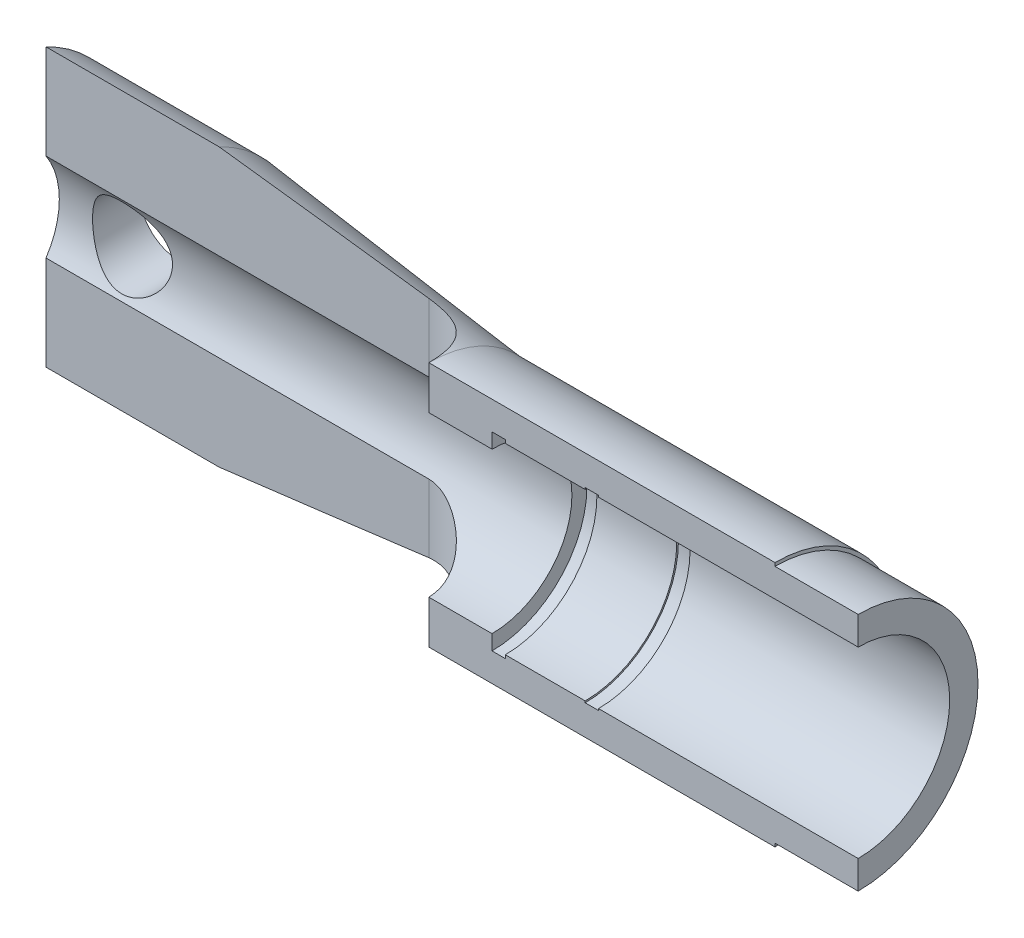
ISO-10303-21;
HEADER;
FILE_DESCRIPTION(('STEP AP214'),'2;1');
FILE_NAME('part.step','',(''),(''),'','','');
FILE_SCHEMA(('AUTOMOTIVE_DESIGN { 1 0 10303 214 1 1 1 1 }'));
ENDSEC;
DATA;
#1=APPLICATION_CONTEXT('core data for automotive mechanical design processes');
#2=APPLICATION_PROTOCOL_DEFINITION('international standard','automotive_design',2000,#1);
#3=PRODUCT_CONTEXT('',#1,'mechanical');
#4=PRODUCT('Part','Part','',(#3));
#5=PRODUCT_RELATED_PRODUCT_CATEGORY('part','',(#4));
#6=PRODUCT_DEFINITION_FORMATION('','',#4);
#7=PRODUCT_DEFINITION_CONTEXT('part definition',#1,'design');
#8=PRODUCT_DEFINITION('design','',#6,#7);
#9=PRODUCT_DEFINITION_SHAPE('','',#8);
#10=(LENGTH_UNIT() NAMED_UNIT(*) SI_UNIT(.MILLI.,.METRE.));
#11=(NAMED_UNIT(*) PLANE_ANGLE_UNIT() SI_UNIT($,.RADIAN.));
#12=(NAMED_UNIT(*) SI_UNIT($,.STERADIAN.) SOLID_ANGLE_UNIT());
#13=UNCERTAINTY_MEASURE_WITH_UNIT(LENGTH_MEASURE(1.E-05),#10,'distance_accuracy_value','');
#14=(GEOMETRIC_REPRESENTATION_CONTEXT(3) GLOBAL_UNCERTAINTY_ASSIGNED_CONTEXT((#13)) GLOBAL_UNIT_ASSIGNED_CONTEXT((#10,
#11,#12)) REPRESENTATION_CONTEXT('',''));
#15=CARTESIAN_POINT('',(0.,0.,0.));
#16=DIRECTION('',(0.,0.,1.));
#17=DIRECTION('',(1.,0.,0.));
#18=AXIS2_PLACEMENT_3D('',#15,#16,#17);
#19=CARTESIAN_POINT('',(0.,0.,0.));
#20=DIRECTION('',(1.,0.,0.));
#21=DIRECTION('',(0.,0.,-1.));
#22=AXIS2_PLACEMENT_3D('',#19,#20,#21);
#23=CYLINDRICAL_SURFACE('',#22,27.5);
#24=CARTESIAN_POINT('',(-78.,0.,0.));
#25=DIRECTION('',(1.,0.,0.));
#26=DIRECTION('',(0.,0.,-1.));
#27=AXIS2_PLACEMENT_3D('',#24,#25,#26);
#28=CIRCLE('',#27,27.5);
#29=CARTESIAN_POINT('',(-78.,-27.5,1.92031473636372E-13));
#30=VERTEX_POINT('',#29);
#31=CARTESIAN_POINT('',(-78.,27.5,0.));
#32=VERTEX_POINT('',#31);
#33=EDGE_CURVE('E223',#30,#32,#28,.T.);
#34=ORIENTED_EDGE('',*,*,#33,.F.);
#35=DIRECTION('',(1.,0.,0.));
#36=VECTOR('',#35,1.);
#37=CARTESIAN_POINT('',(0.,-27.5,1.92031473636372E-13));
#38=LINE('',#37,#36);
#39=CARTESIAN_POINT('',(0.,-27.5,1.92031473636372E-13));
#40=VERTEX_POINT('',#39);
#41=EDGE_CURVE('E417',#30,#40,#38,.T.);
#42=ORIENTED_EDGE('',*,*,#41,.T.);
#43=CARTESIAN_POINT('',(0.,0.,0.));
#44=DIRECTION('',(1.,0.,0.));
#45=DIRECTION('',(0.,0.,-1.));
#46=AXIS2_PLACEMENT_3D('',#43,#44,#45);
#47=CIRCLE('',#46,27.5);
#48=CARTESIAN_POINT('',(0.,27.5,0.));
#49=VERTEX_POINT('',#48);
#50=EDGE_CURVE('E355',#40,#49,#47,.T.);
#51=ORIENTED_EDGE('',*,*,#50,.T.);
#52=DIRECTION('',(1.,0.,0.));
#53=VECTOR('',#52,1.);
#54=CARTESIAN_POINT('',(0.,27.5,0.));
#55=LINE('',#54,#53);
#56=EDGE_CURVE('E380',#32,#49,#55,.T.);
#57=ORIENTED_EDGE('',*,*,#56,.F.);
#58=EDGE_LOOP('',(#34,#42,#51,#57));
#59=FACE_BOUND('',#58,.T.);
#60=ADVANCED_FACE('F33',(#59),#23,.F.);
#61=CARTESIAN_POINT('',(-78.,-27.5,1.92031473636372E-13));
#62=DIRECTION('',(-1.,0.,0.));
#63=DIRECTION('',(0.,0.,1.));
#64=AXIS2_PLACEMENT_3D('',#61,#62,#63);
#65=PLANE('',#64);
#66=CARTESIAN_POINT('',(-78.,0.,0.));
#67=DIRECTION('',(1.,0.,0.));
#68=DIRECTION('',(0.,0.,-1.));
#69=AXIS2_PLACEMENT_3D('',#66,#67,#68);
#70=CIRCLE('',#69,28.);
#71=CARTESIAN_POINT('',(-78.,-28.,1.95522954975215E-13));
#72=VERTEX_POINT('',#71);
#73=CARTESIAN_POINT('',(-78.,28.,0.));
#74=VERTEX_POINT('',#73);
#75=EDGE_CURVE('E221',#72,#74,#70,.T.);
#76=ORIENTED_EDGE('',*,*,#75,.F.);
#77=DIRECTION('',(0.,1.,0.));
#78=VECTOR('',#77,1.);
#79=CARTESIAN_POINT('',(-78.,-27.5,1.92031473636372E-13));
#80=LINE('',#79,#78);
#81=EDGE_CURVE('E352',#72,#30,#80,.T.);
#82=ORIENTED_EDGE('',*,*,#81,.T.);
#83=ORIENTED_EDGE('',*,*,#33,.T.);
#84=DIRECTION('',(0.,-1.,0.));
#85=VECTOR('',#84,1.);
#86=CARTESIAN_POINT('',(-78.,27.5,0.));
#87=LINE('',#86,#85);
#88=EDGE_CURVE('E414',#74,#32,#87,.T.);
#89=ORIENTED_EDGE('',*,*,#88,.F.);
#90=EDGE_LOOP('',(#76,#82,#83,#89));
#91=FACE_BOUND('',#90,.T.);
#92=ADVANCED_FACE('F35',(#91),#65,.T.);
#93=CARTESIAN_POINT('',(0.,0.,0.));
#94=DIRECTION('',(1.,0.,0.));
#95=DIRECTION('',(0.,0.,-1.));
#96=AXIS2_PLACEMENT_3D('',#93,#94,#95);
#97=CYLINDRICAL_SURFACE('',#96,28.);
#98=CARTESIAN_POINT('',(-82.,0.,0.));
#99=DIRECTION('',(1.,0.,0.));
#100=DIRECTION('',(0.,0.,-1.));
#101=AXIS2_PLACEMENT_3D('',#98,#99,#100);
#102=CIRCLE('',#101,28.);
#103=CARTESIAN_POINT('',(-82.,-28.,1.95522954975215E-13));
#104=VERTEX_POINT('',#103);
#105=CARTESIAN_POINT('',(-82.,28.,0.));
#106=VERTEX_POINT('',#105);
#107=EDGE_CURVE('E219',#104,#106,#102,.T.);
#108=ORIENTED_EDGE('',*,*,#107,.F.);
#109=DIRECTION('',(1.,0.,0.));
#110=VECTOR('',#109,1.);
#111=CARTESIAN_POINT('',(-78.,-28.,1.95522954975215E-13));
#112=LINE('',#111,#110);
#113=EDGE_CURVE('E349',#104,#72,#112,.T.);
#114=ORIENTED_EDGE('',*,*,#113,.T.);
#115=ORIENTED_EDGE('',*,*,#75,.T.);
#116=DIRECTION('',(1.,0.,0.));
#117=VECTOR('',#116,1.);
#118=CARTESIAN_POINT('',(-78.,28.,0.));
#119=LINE('',#118,#117);
#120=EDGE_CURVE('E411',#106,#74,#119,.T.);
#121=ORIENTED_EDGE('',*,*,#120,.F.);
#122=EDGE_LOOP('',(#108,#114,#115,#121));
#123=FACE_BOUND('',#122,.T.);
#124=ADVANCED_FACE('F450',(#123),#97,.F.);
#125=CARTESIAN_POINT('',(-82.,-28.,1.95522954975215E-13));
#126=DIRECTION('',(1.,0.,0.));
#127=DIRECTION('',(0.,0.,-1.));
#128=AXIS2_PLACEMENT_3D('',#125,#126,#127);
#129=PLANE('',#128);
#130=CARTESIAN_POINT('',(-82.,0.,0.));
#131=DIRECTION('',(1.,0.,0.));
#132=DIRECTION('',(0.,0.,-1.));
#133=AXIS2_PLACEMENT_3D('',#130,#131,#132);
#134=CIRCLE('',#133,27.5);
#135=CARTESIAN_POINT('',(-82.,-27.5,1.92031473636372E-13));
#136=VERTEX_POINT('',#135);
#137=CARTESIAN_POINT('',(-82.,27.5,0.));
#138=VERTEX_POINT('',#137);
#139=EDGE_CURVE('E217',#136,#138,#134,.T.);
#140=ORIENTED_EDGE('',*,*,#139,.F.);
#141=DIRECTION('',(0.,-1.,0.));
#142=VECTOR('',#141,1.);
#143=CARTESIAN_POINT('',(-82.,-28.,1.95522954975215E-13));
#144=LINE('',#143,#142);
#145=EDGE_CURVE('E346',#136,#104,#144,.T.);
#146=ORIENTED_EDGE('',*,*,#145,.T.);
#147=ORIENTED_EDGE('',*,*,#107,.T.);
#148=DIRECTION('',(0.,1.,0.));
#149=VECTOR('',#148,1.);
#150=CARTESIAN_POINT('',(-82.,28.,0.));
#151=LINE('',#150,#149);
#152=EDGE_CURVE('E408',#138,#106,#151,.T.);
#153=ORIENTED_EDGE('',*,*,#152,.F.);
#154=EDGE_LOOP('',(#140,#146,#147,#153));
#155=FACE_BOUND('',#154,.T.);
#156=ADVANCED_FACE('F454',(#155),#129,.T.);
#157=CARTESIAN_POINT('',(0.,0.,0.));
#158=DIRECTION('',(1.,0.,0.));
#159=DIRECTION('',(0.,0.,-1.));
#160=AXIS2_PLACEMENT_3D('',#157,#158,#159);
#161=CYLINDRICAL_SURFACE('',#160,27.5);
#162=CARTESIAN_POINT('',(-106.,0.,0.));
#163=DIRECTION('',(1.,0.,0.));
#164=DIRECTION('',(0.,0.,-1.));
#165=AXIS2_PLACEMENT_3D('',#162,#163,#164);
#166=CIRCLE('',#165,27.5);
#167=CARTESIAN_POINT('',(-106.,-27.5,1.92031473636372E-13));
#168=VERTEX_POINT('',#167);
#169=CARTESIAN_POINT('',(-106.,27.5,0.));
#170=VERTEX_POINT('',#169);
#171=EDGE_CURVE('E215',#168,#170,#166,.T.);
#172=ORIENTED_EDGE('',*,*,#171,.F.);
#173=DIRECTION('',(1.,0.,0.));
#174=VECTOR('',#173,1.);
#175=CARTESIAN_POINT('',(-82.,-27.5,1.92031473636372E-13));
#176=LINE('',#175,#174);
#177=EDGE_CURVE('E343',#168,#136,#176,.T.);
#178=ORIENTED_EDGE('',*,*,#177,.T.);
#179=ORIENTED_EDGE('',*,*,#139,.T.);
#180=DIRECTION('',(1.,0.,0.));
#181=VECTOR('',#180,1.);
#182=CARTESIAN_POINT('',(-82.,27.5,0.));
#183=LINE('',#182,#181);
#184=EDGE_CURVE('E405',#170,#138,#183,.T.);
#185=ORIENTED_EDGE('',*,*,#184,.F.);
#186=EDGE_LOOP('',(#172,#178,#179,#185));
#187=FACE_BOUND('',#186,.T.);
#188=ADVANCED_FACE('F457',(#187),#161,.F.);
#189=CARTESIAN_POINT('',(-106.,-27.5,1.92031473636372E-13));
#190=DIRECTION('',(-1.,0.,0.));
#191=DIRECTION('',(0.,0.,1.));
#192=AXIS2_PLACEMENT_3D('',#189,#190,#191);
#193=PLANE('',#192);
#194=CARTESIAN_POINT('',(-106.,0.,0.));
#195=DIRECTION('',(1.,0.,0.));
#196=DIRECTION('',(0.,0.,-1.));
#197=AXIS2_PLACEMENT_3D('',#194,#195,#196);
#198=CIRCLE('',#197,28.5);
#199=CARTESIAN_POINT('',(-106.,-28.5,1.99014436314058E-13));
#200=VERTEX_POINT('',#199);
#201=CARTESIAN_POINT('',(-106.,28.5,0.));
#202=VERTEX_POINT('',#201);
#203=EDGE_CURVE('E213',#200,#202,#198,.T.);
#204=ORIENTED_EDGE('',*,*,#203,.F.);
#205=DIRECTION('',(0.,1.,0.));
#206=VECTOR('',#205,1.);
#207=CARTESIAN_POINT('',(-106.,-27.5,1.92031473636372E-13));
#208=LINE('',#207,#206);
#209=EDGE_CURVE('E340',#200,#168,#208,.T.);
#210=ORIENTED_EDGE('',*,*,#209,.T.);
#211=ORIENTED_EDGE('',*,*,#171,.T.);
#212=DIRECTION('',(0.,-1.,0.));
#213=VECTOR('',#212,1.);
#214=CARTESIAN_POINT('',(-106.,27.5,0.));
#215=LINE('',#214,#213);
#216=EDGE_CURVE('E402',#202,#170,#215,.T.);
#217=ORIENTED_EDGE('',*,*,#216,.F.);
#218=EDGE_LOOP('',(#204,#210,#211,#217));
#219=FACE_BOUND('',#218,.T.);
#220=ADVANCED_FACE('F460',(#219),#193,.T.);
#221=CARTESIAN_POINT('',(0.,0.,0.));
#222=DIRECTION('',(1.,0.,0.));
#223=DIRECTION('',(0.,0.,-1.));
#224=AXIS2_PLACEMENT_3D('',#221,#222,#223);
#225=CYLINDRICAL_SURFACE('',#224,28.5);
#226=CARTESIAN_POINT('',(-110.,0.,0.));
#227=DIRECTION('',(1.,0.,0.));
#228=DIRECTION('',(0.,0.,-1.));
#229=AXIS2_PLACEMENT_3D('',#226,#227,#228);
#230=CIRCLE('',#229,28.5);
#231=CARTESIAN_POINT('',(-110.,-28.5,1.99014436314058E-13));
#232=VERTEX_POINT('',#231);
#233=CARTESIAN_POINT('',(-110.,28.5,0.));
#234=VERTEX_POINT('',#233);
#235=EDGE_CURVE('E211',#232,#234,#230,.T.);
#236=ORIENTED_EDGE('',*,*,#235,.F.);
#237=DIRECTION('',(1.,0.,0.));
#238=VECTOR('',#237,1.);
#239=CARTESIAN_POINT('',(-106.,-28.5,1.99014436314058E-13));
#240=LINE('',#239,#238);
#241=EDGE_CURVE('E331',#232,#200,#240,.T.);
#242=ORIENTED_EDGE('',*,*,#241,.T.);
#243=ORIENTED_EDGE('',*,*,#203,.T.);
#244=DIRECTION('',(1.,0.,0.));
#245=VECTOR('',#244,1.);
#246=CARTESIAN_POINT('',(-106.,28.5,0.));
#247=LINE('',#246,#245);
#248=EDGE_CURVE('E399',#234,#202,#247,.T.);
#249=ORIENTED_EDGE('',*,*,#248,.F.);
#250=EDGE_LOOP('',(#236,#242,#243,#249));
#251=FACE_BOUND('',#250,.T.);
#252=ADVANCED_FACE('F464',(#251),#225,.F.);
#253=CARTESIAN_POINT('',(-110.,-28.5,1.99014436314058E-13));
#254=DIRECTION('',(1.,0.,0.));
#255=DIRECTION('',(0.,0.,-1.));
#256=AXIS2_PLACEMENT_3D('',#253,#254,#255);
#257=PLANE('',#256);
#258=CARTESIAN_POINT('',(-110.,0.,0.));
#259=DIRECTION('',(1.,0.,0.));
#260=DIRECTION('',(0.,0.,-1.));
#261=AXIS2_PLACEMENT_3D('',#258,#259,#260);
#262=CIRCLE('',#261,24.);
#263=CARTESIAN_POINT('',(-110.,-24.,1.6759110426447E-13));
#264=VERTEX_POINT('',#263);
#265=CARTESIAN_POINT('',(-110.,24.,0.));
#266=VERTEX_POINT('',#265);
#267=EDGE_CURVE('E203',#264,#266,#262,.T.);
#268=ORIENTED_EDGE('',*,*,#267,.F.);
#269=DIRECTION('',(0.,-1.,0.));
#270=VECTOR('',#269,1.);
#271=CARTESIAN_POINT('',(-110.,-28.5,1.99014436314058E-13));
#272=LINE('',#271,#270);
#273=EDGE_CURVE('E328',#264,#232,#272,.T.);
#274=ORIENTED_EDGE('',*,*,#273,.T.);
#275=ORIENTED_EDGE('',*,*,#235,.T.);
#276=DIRECTION('',(0.,1.,0.));
#277=VECTOR('',#276,1.);
#278=CARTESIAN_POINT('',(-110.,28.5,0.));
#279=LINE('',#278,#277);
#280=EDGE_CURVE('E396',#266,#234,#279,.T.);
#281=ORIENTED_EDGE('',*,*,#280,.F.);
#282=EDGE_LOOP('',(#268,#274,#275,#281));
#283=FACE_BOUND('',#282,.T.);
#284=ADVANCED_FACE('F289',(#283),#257,.T.);
#285=CARTESIAN_POINT('',(0.,0.,0.));
#286=DIRECTION('',(1.,0.,0.));
#287=DIRECTION('',(0.,0.,-1.));
#288=AXIS2_PLACEMENT_3D('',#285,#286,#287);
#289=CYLINDRICAL_SURFACE('',#288,24.);
#290=CARTESIAN_POINT('',(-230.,0.,-24.));
#291=CARTESIAN_POINT('',(-230.000001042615,0.315573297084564,-23.9999990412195));
#292=CARTESIAN_POINT('',(-230.012462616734,0.631168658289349,-23.99376130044));
#293=CARTESIAN_POINT('',(-230.062166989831,1.26003507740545,-23.9689674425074));
#294=CARTESIAN_POINT('',(-230.09942056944,1.57330506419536,-23.950405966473));
#295=CARTESIAN_POINT('',(-230.198350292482,2.19555871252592,-23.9014034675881));
#296=CARTESIAN_POINT('',(-230.260067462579,2.50453426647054,-23.8709424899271));
#297=CARTESIAN_POINT('',(-230.407205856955,3.11541819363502,-23.7989236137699));
#298=CARTESIAN_POINT('',(-230.492624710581,3.41732727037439,-23.7573668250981));
#299=CARTESIAN_POINT('',(-230.685882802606,4.01096204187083,-23.6643636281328));
#300=CARTESIAN_POINT('',(-230.793633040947,4.30272294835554,-23.6129565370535));
#301=CARTESIAN_POINT('',(-231.030733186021,4.87558118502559,-23.5013590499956));
#302=CARTESIAN_POINT('',(-231.160083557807,5.15667828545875,-23.4411684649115));
#303=CARTESIAN_POINT('',(-231.439243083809,5.70661678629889,-23.3133908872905));
#304=CARTESIAN_POINT('',(-231.589044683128,5.97546266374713,-23.2458066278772));
#305=CARTESIAN_POINT('',(-231.908104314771,6.49983696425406,-23.1046723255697));
#306=CARTESIAN_POINT('',(-232.07737001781,6.75536007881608,-23.0311199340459));
#307=CARTESIAN_POINT('',(-232.445005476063,7.26685384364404,-22.8750644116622));
#308=CARTESIAN_POINT('',(-232.644514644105,7.52192271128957,-22.7922889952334));
#309=CARTESIAN_POINT('',(-233.062934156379,8.01456886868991,-22.6237591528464));
#310=CARTESIAN_POINT('',(-233.281845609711,8.25214515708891,-22.5380045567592));
#311=CARTESIAN_POINT('',(-233.738046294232,8.70886687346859,-22.3654927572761));
#312=CARTESIAN_POINT('',(-233.975346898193,8.92800071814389,-22.2787349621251));
#313=CARTESIAN_POINT('',(-234.467122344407,9.34666033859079,-22.1063612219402));
#314=CARTESIAN_POINT('',(-234.721600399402,9.54618242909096,-22.0207454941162));
#315=CARTESIAN_POINT('',(-235.267031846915,9.93925333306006,-21.846304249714));
#316=CARTESIAN_POINT('',(-235.559282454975,10.13112679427,-21.7577480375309));
#317=CARTESIAN_POINT('',(-236.160750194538,10.4893097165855,-21.5873508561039));
#318=CARTESIAN_POINT('',(-236.46996006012,10.6556300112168,-21.5055070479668));
#319=CARTESIAN_POINT('',(-237.103639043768,10.9612653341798,-21.3513457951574));
#320=CARTESIAN_POINT('',(-237.428103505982,11.1005885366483,-21.2790254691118));
#321=CARTESIAN_POINT('',(-238.090263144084,11.3507342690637,-21.1466519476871));
#322=CARTESIAN_POINT('',(-238.427956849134,11.4615599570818,-21.0865973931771));
#323=CARTESIAN_POINT('',(-239.093498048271,11.6475055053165,-20.9844274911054));
#324=CARTESIAN_POINT('',(-239.420727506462,11.7243636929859,-20.9414544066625));
#325=CARTESIAN_POINT('',(-240.082059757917,11.8505186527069,-20.8703253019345));
#326=CARTESIAN_POINT('',(-240.416162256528,11.8998166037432,-20.8421686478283));
#327=CARTESIAN_POINT('',(-241.088017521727,11.9700573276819,-20.8019079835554));
#328=CARTESIAN_POINT('',(-241.425766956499,11.9910240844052,-20.7897903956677));
#329=CARTESIAN_POINT('',(-242.102003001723,12.0043296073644,-20.7821111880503));
#330=CARTESIAN_POINT('',(-242.440489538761,11.9966711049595,-20.7865479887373));
#331=CARTESIAN_POINT('',(-243.074548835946,11.9554954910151,-20.8102516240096));
#332=CARTESIAN_POINT('',(-243.370405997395,11.9251852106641,-20.8276786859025));
#333=CARTESIAN_POINT('',(-243.958091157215,11.8428838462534,-20.8745861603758));
#334=CARTESIAN_POINT('',(-244.249919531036,11.7908947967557,-20.9040654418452));
#335=CARTESIAN_POINT('',(-244.827720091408,11.6658222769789,-20.974120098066));
#336=CARTESIAN_POINT('',(-245.113690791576,11.5927335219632,-21.0146982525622));
#337=CARTESIAN_POINT('',(-245.678040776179,11.4262234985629,-21.1056960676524));
#338=CARTESIAN_POINT('',(-245.956419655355,11.3328011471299,-21.1561162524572));
#339=CARTESIAN_POINT('',(-246.510449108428,11.1240948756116,-21.2666114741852));
#340=CARTESIAN_POINT('',(-246.785889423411,11.008357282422,-21.3268820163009));
#341=CARTESIAN_POINT('',(-247.326119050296,10.7573792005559,-21.4545709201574));
#342=CARTESIAN_POINT('',(-247.590904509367,10.6221317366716,-21.5219918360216));
#343=CARTESIAN_POINT('',(-248.108671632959,10.3330565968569,-21.6622655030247));
#344=CARTESIAN_POINT('',(-248.361651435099,10.1792260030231,-21.7351191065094));
#345=CARTESIAN_POINT('',(-248.854818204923,9.85386986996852,-21.884544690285));
#346=CARTESIAN_POINT('',(-249.095004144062,9.68234291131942,-21.9611169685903));
#347=CARTESIAN_POINT('',(-249.591370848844,9.29953768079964,-22.1261694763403));
#348=CARTESIAN_POINT('',(-249.845704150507,9.08597796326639,-22.214926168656));
#349=CARTESIAN_POINT('',(-250.335672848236,8.63866698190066,-22.392662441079));
#350=CARTESIAN_POINT('',(-250.571314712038,8.40492276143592,-22.4816419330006));
#351=CARTESIAN_POINT('',(-251.022976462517,7.91809528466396,-22.6576877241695));
#352=CARTESIAN_POINT('',(-251.238978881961,7.66499517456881,-22.7447522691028));
#353=CARTESIAN_POINT('',(-251.649744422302,7.14095403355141,-22.9146812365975));
#354=CARTESIAN_POINT('',(-251.844516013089,6.87002018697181,-22.9975473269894));
#355=CARTESIAN_POINT('',(-252.220155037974,6.29847321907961,-23.1607776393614));
#356=CARTESIAN_POINT('',(-252.399945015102,5.99706449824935,-23.2408432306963));
#357=CARTESIAN_POINT('',(-252.73324308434,5.3778359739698,-23.3918881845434));
#358=CARTESIAN_POINT('',(-252.886749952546,5.06001540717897,-23.4628671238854));
#359=CARTESIAN_POINT('',(-253.165753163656,4.41031227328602,-23.5936190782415));
#360=CARTESIAN_POINT('',(-253.291267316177,4.07843880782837,-23.6533992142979));
#361=CARTESIAN_POINT('',(-253.512860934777,3.40298717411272,-23.7599772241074));
#362=CARTESIAN_POINT('',(-253.608943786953,3.05941035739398,-23.8067765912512));
#363=CARTESIAN_POINT('',(-253.763679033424,2.39232098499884,-23.8826295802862));
#364=CARTESIAN_POINT('',(-253.824772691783,2.0695039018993,-23.9128320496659));
#365=CARTESIAN_POINT('',(-253.920338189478,1.41900713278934,-23.9602323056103));
#366=CARTESIAN_POINT('',(-253.954811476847,1.09132771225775,-23.9774307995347));
#367=CARTESIAN_POINT('',(-253.996671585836,0.433945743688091,-23.9983291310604));
#368=CARTESIAN_POINT('',(-254.004069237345,0.104244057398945,-24.0020343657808));
#369=CARTESIAN_POINT('',(-253.991706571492,-0.55451434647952,-23.9958536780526));
#370=CARTESIAN_POINT('',(-253.971947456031,-0.883571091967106,-23.9859683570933));
#371=CARTESIAN_POINT('',(-253.908125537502,-1.51283492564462,-23.9541805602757));
#372=CARTESIAN_POINT('',(-253.866068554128,-1.81329854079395,-23.9332705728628));
#373=CARTESIAN_POINT('',(-253.759555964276,-2.40924407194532,-23.8806409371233));
#374=CARTESIAN_POINT('',(-253.695101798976,-2.70472630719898,-23.8489219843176));
#375=CARTESIAN_POINT('',(-253.544463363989,-3.28882114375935,-23.7754141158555));
#376=CARTESIAN_POINT('',(-253.458277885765,-3.57743336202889,-23.7336246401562));
#377=CARTESIAN_POINT('',(-253.26500583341,-4.14606176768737,-23.6409215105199));
#378=CARTESIAN_POINT('',(-253.157918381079,-4.42607759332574,-23.5900074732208));
#379=CARTESIAN_POINT('',(-252.920452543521,-4.98379006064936,-23.4786068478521));
#380=CARTESIAN_POINT('',(-252.789499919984,-5.26119588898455,-23.4178897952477));
#381=CARTESIAN_POINT('',(-252.507494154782,-5.80397665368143,-23.2893040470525));
#382=CARTESIAN_POINT('',(-252.356433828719,-6.06934724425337,-23.2214327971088));
#383=CARTESIAN_POINT('',(-252.035288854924,-6.58678352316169,-23.0799964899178));
#384=CARTESIAN_POINT('',(-251.865200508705,-6.83884661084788,-23.0064303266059));
#385=CARTESIAN_POINT('',(-251.507079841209,-7.32853684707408,-22.8551575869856));
#386=CARTESIAN_POINT('',(-251.319048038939,-7.56616441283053,-22.7774511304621));
#387=CARTESIAN_POINT('',(-250.906697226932,-8.04867125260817,-22.6117268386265));
#388=CARTESIAN_POINT('',(-250.680628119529,-8.29196695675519,-22.5234462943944));
#389=CARTESIAN_POINT('',(-250.209292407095,-8.75885661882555,-22.346024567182));
#390=CARTESIAN_POINT('',(-249.964024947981,-8.98244969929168,-22.2568833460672));
#391=CARTESIAN_POINT('',(-249.455351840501,-9.40892924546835,-22.0799769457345));
#392=CARTESIAN_POINT('',(-249.191935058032,-9.61180280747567,-21.992212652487));
#393=CARTESIAN_POINT('',(-248.648295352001,-9.99554332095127,-21.8204793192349));
#394=CARTESIAN_POINT('',(-248.36807001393,-10.1764070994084,-21.7365108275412));
#395=CARTESIAN_POINT('',(-247.778093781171,-10.5231332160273,-21.5708686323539));
#396=CARTESIAN_POINT('',(-247.467569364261,-10.6878325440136,-21.4895069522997));
#397=CARTESIAN_POINT('',(-246.831424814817,-10.9900529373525,-21.3365281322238));
#398=CARTESIAN_POINT('',(-246.505812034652,-11.1275870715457,-21.2649063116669));
#399=CARTESIAN_POINT('',(-245.841740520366,-11.3739321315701,-21.1341695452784));
#400=CARTESIAN_POINT('',(-245.503292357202,-11.4827661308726,-21.075044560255));
#401=CARTESIAN_POINT('',(-244.815940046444,-11.6703611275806,-20.9717472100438));
#402=CARTESIAN_POINT('',(-244.467037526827,-11.7491267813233,-20.9275725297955));
#403=CARTESIAN_POINT('',(-243.795770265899,-11.8692907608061,-20.8596313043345));
#404=CARTESIAN_POINT('',(-243.474073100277,-11.9135502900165,-20.8343127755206));
#405=CARTESIAN_POINT('',(-242.827327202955,-11.9758523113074,-20.7985641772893));
#406=CARTESIAN_POINT('',(-242.502278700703,-11.9938965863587,-20.7881330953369));
#407=CARTESIAN_POINT('',(-241.851783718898,-12.0034916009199,-20.7825941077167));
#408=CARTESIAN_POINT('',(-241.526337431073,-11.9950521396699,-20.7874805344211));
#409=CARTESIAN_POINT('',(-240.877793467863,-11.9518307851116,-20.8123607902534));
#410=CARTESIAN_POINT('',(-240.554695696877,-11.9170499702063,-20.8323540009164));
#411=CARTESIAN_POINT('',(-239.944262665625,-11.8262366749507,-20.8840261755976));
#412=CARTESIAN_POINT('',(-239.656462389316,-11.7725547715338,-20.9144046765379));
#413=CARTESIAN_POINT('',(-239.086724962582,-11.6446594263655,-20.9858826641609));
#414=CARTESIAN_POINT('',(-238.804789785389,-11.5704391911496,-21.0269856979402));
#415=CARTESIAN_POINT('',(-238.248531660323,-11.4022327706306,-21.1186705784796));
#416=CARTESIAN_POINT('',(-237.974207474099,-11.3082498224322,-21.16925087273));
#417=CARTESIAN_POINT('',(-237.434361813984,-11.1012865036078,-21.278513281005));
#418=CARTESIAN_POINT('',(-237.168844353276,-10.9882976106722,-21.3371990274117));
#419=CARTESIAN_POINT('',(-236.630448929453,-10.7360194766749,-21.4653024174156));
#420=CARTESIAN_POINT('',(-236.35826698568,-10.5954764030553,-21.535175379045));
#421=CARTESIAN_POINT('',(-235.826545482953,-10.2947448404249,-21.6805469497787));
#422=CARTESIAN_POINT('',(-235.56700705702,-10.1345545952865,-21.7560460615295));
#423=CARTESIAN_POINT('',(-235.061538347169,-9.79542789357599,-21.9108269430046));
#424=CARTESIAN_POINT('',(-234.815612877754,-9.61648486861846,-21.9901100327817));
#425=CARTESIAN_POINT('',(-234.338397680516,-9.24078422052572,-22.1506126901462));
#426=CARTESIAN_POINT('',(-234.107110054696,-9.04402404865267,-22.2318325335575));
#427=CARTESIAN_POINT('',(-233.632893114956,-8.60856403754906,-22.4043282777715));
#428=CARTESIAN_POINT('',(-233.391976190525,-8.36767481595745,-22.4956242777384));
#429=CARTESIAN_POINT('',(-232.931178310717,-7.86590560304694,-22.6759471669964));
#430=CARTESIAN_POINT('',(-232.711291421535,-7.60503128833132,-22.7649746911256));
#431=CARTESIAN_POINT('',(-232.293706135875,-7.06432051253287,-22.9385275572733));
#432=CARTESIAN_POINT('',(-232.096025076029,-6.78446950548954,-23.023049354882));
#433=CARTESIAN_POINT('',(-231.724545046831,-6.20747453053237,-23.1852766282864));
#434=CARTESIAN_POINT('',(-231.550744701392,-5.91033156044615,-23.2629824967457));
#435=CARTESIAN_POINT('',(-231.227374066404,-5.29822602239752,-23.4100101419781));
#436=CARTESIAN_POINT('',(-231.077989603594,-4.98314936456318,-23.4792666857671));
#437=CARTESIAN_POINT('',(-230.806583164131,-4.33929014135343,-23.6067410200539));
#438=CARTESIAN_POINT('',(-230.684557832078,-4.01050926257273,-23.664960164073));
#439=CARTESIAN_POINT('',(-230.469575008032,-3.34247342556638,-23.7685053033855));
#440=CARTESIAN_POINT('',(-230.376548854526,-3.00324533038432,-23.8138617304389));
#441=CARTESIAN_POINT('',(-230.220468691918,-2.31656786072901,-23.8904314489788));
#442=CARTESIAN_POINT('',(-230.157396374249,-1.96912364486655,-23.9216533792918));
#443=CARTESIAN_POINT('',(-230.07326131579,-1.35130022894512,-23.9634331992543));
#444=CARTESIAN_POINT('',(-230.045811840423,-1.08198201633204,-23.9771217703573));
#445=CARTESIAN_POINT('',(-230.009180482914,-0.541781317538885,-23.9954057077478));
#446=CARTESIAN_POINT('',(-229.999999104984,-0.27089878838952,-24.0000008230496));
#447=CARTESIAN_POINT('',(-230.,0.,-24.));
#448=B_SPLINE_CURVE_WITH_KNOTS('',3,(#290,#291,#292,#293,#294,#295,#296,#297,#298,#299,#300,
#301,#302,#303,#304,#305,#306,#307,#308,#309,#310,#311,#312,#313,#314,#315,#316,#317,#318,#319,
#320,#321,#322,#323,#324,#325,#326,#327,#328,#329,#330,#331,#332,#333,#334,#335,#336,#337,#338,
#339,#340,#341,#342,#343,#344,#345,#346,#347,#348,#349,#350,#351,#352,#353,#354,#355,#356,#357,
#358,#359,#360,#361,#362,#363,#364,#365,#366,#367,#368,#369,#370,#371,#372,#373,#374,#375,#376,
#377,#378,#379,#380,#381,#382,#383,#384,#385,#386,#387,#388,#389,#390,#391,#392,#393,#394,#395,
#396,#397,#398,#399,#400,#401,#402,#403,#404,#405,#406,#407,#408,#409,#410,#411,#412,#413,#414,
#415,#416,#417,#418,#419,#420,#421,#422,#423,#424,#425,#426,#427,#428,#429,#430,#431,#432,#433,
#434,#435,#436,#437,#438,#439,#440,#441,#442,#443,#444,#445,#446,#447),.UNSPECIFIED.,.T.,.F.,(4,
2,2,2,2,2,2,2,2,2,2,2,2,2,2,2,2,2,2,2,2,2,2,2,2,2,2,2,2,2,2,2,2,2,2,2,2,2,2,2,2,2,2,2,2,2,2,2,2,
2,2,2,2,2,2,2,2,2,2,2,2,2,2,2,2,2,2,2,2,2,2,2,2,2,2,2,2,2,4),(0.,0.946452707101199,
1.89331724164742,2.84177647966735,3.79014088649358,4.7347959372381,5.67947132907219,
6.62379868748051,7.56849948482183,8.57015528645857,9.57186838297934,10.5742060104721,
11.5767316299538,12.6573337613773,13.7374764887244,14.8172916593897,15.8969871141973,
16.9121438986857,17.9272572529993,18.9415107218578,19.9556674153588,20.8483627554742,
21.7409743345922,22.6338096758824,23.5266925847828,24.440125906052,25.3538866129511,
26.2677909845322,27.1817687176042,28.2119200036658,29.2417132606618,30.2724136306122,
31.3027012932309,32.381211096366,33.4597711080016,34.5376429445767,35.6153907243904,
36.603863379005,37.5922822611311,38.5803057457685,39.5682855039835,40.4795666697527,
41.3907892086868,42.3020624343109,43.2133739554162,44.1505216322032,45.0880050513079,
46.0256710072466,46.9633098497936,47.9931243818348,49.0229847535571,50.0534826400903,
51.0841289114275,52.1650777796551,53.24550534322,54.3250616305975,55.4044506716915,
56.3802259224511,57.3559348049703,58.3312827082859,59.3065906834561,60.1886227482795,
61.0709469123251,61.953126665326,62.8357030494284,63.7773264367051,64.7190340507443,
65.6610726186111,66.603246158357,67.6601582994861,68.7167713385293,69.7742036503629,
70.831575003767,71.8966527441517,72.961599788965,74.0240058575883,75.0857617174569,
75.8982062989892,76.7106733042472),.UNSPECIFIED.);
#449=CARTESIAN_POINT('',(-230.,0.,-24.));
#450=VERTEX_POINT('',#449);
#451=EDGE_CURVE('E184',#450,#450,#448,.T.);
#452=ORIENTED_EDGE('',*,*,#451,.F.);
#453=EDGE_LOOP('',(#452));
#454=FACE_BOUND('',#453,.T.);
#455=DIRECTION('',(1.,0.,0.));
#456=VECTOR('',#455,1.);
#457=CARTESIAN_POINT('',(0.,-13.2664991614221,-19.9999999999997));
#458=LINE('',#457,#456);
#459=CARTESIAN_POINT('',(-149.,-13.2664991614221,-19.9999999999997));
#460=VERTEX_POINT('',#459);
#461=CARTESIAN_POINT('',(-264.,-13.2664991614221,-19.9999999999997));
#462=VERTEX_POINT('',#461);
#463=EDGE_CURVE('E322',#460,#462,#458,.F.);
#464=ORIENTED_EDGE('',*,*,#463,.F.);
#465=CARTESIAN_POINT('',(-129.,-24.,1.74938985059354E-13));
#466=CARTESIAN_POINT('',(-128.999993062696,-24.0000072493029,-0.238682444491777));
#467=CARTESIAN_POINT('',(-129.004272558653,-23.9964395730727,-0.477360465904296));
#468=CARTESIAN_POINT('',(-129.021352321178,-23.9822084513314,-0.954188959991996));
#469=CARTESIAN_POINT('',(-129.034152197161,-23.9715453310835,-1.19233945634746));
#470=CARTESIAN_POINT('',(-129.06820886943,-23.943187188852,-1.6674520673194));
#471=CARTESIAN_POINT('',(-129.089459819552,-23.9254970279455,-1.90441488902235));
#472=CARTESIAN_POINT('',(-129.140310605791,-23.8831963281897,-2.37680451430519));
#473=CARTESIAN_POINT('',(-129.169910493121,-23.8585857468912,-2.61223130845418));
#474=CARTESIAN_POINT('',(-129.270528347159,-23.7750001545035,-3.31189563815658));
#475=CARTESIAN_POINT('',(-129.353639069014,-23.7060418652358,-3.77329657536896));
#476=CARTESIAN_POINT('',(-129.550833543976,-23.5428762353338,-4.68482014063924));
#477=CARTESIAN_POINT('',(-129.664921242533,-23.4486656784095,-5.13494132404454));
#478=CARTESIAN_POINT('',(-129.921949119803,-23.2371836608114,-6.01994428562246));
#479=CARTESIAN_POINT('',(-130.064813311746,-23.1199729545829,-6.45486273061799));
#480=CARTESIAN_POINT('',(-130.377598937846,-22.8645070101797,-7.30840731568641));
#481=CARTESIAN_POINT('',(-130.547519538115,-22.7262524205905,-7.7270339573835));
#482=CARTESIAN_POINT('',(-130.912706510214,-22.4307523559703,-8.5470227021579));
#483=CARTESIAN_POINT('',(-131.108014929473,-22.273475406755,-8.94835465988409));
#484=CARTESIAN_POINT('',(-131.521806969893,-21.942466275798,-9.73186217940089));
#485=CARTESIAN_POINT('',(-131.740295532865,-21.7687305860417,-10.1140336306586));
#486=CARTESIAN_POINT('',(-132.28261708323,-21.3408942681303,-10.9948073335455));
#487=CARTESIAN_POINT('',(-132.615716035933,-21.0806720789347,-11.4847626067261));
#488=CARTESIAN_POINT('',(-133.31774732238,-20.5397889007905,-12.4262647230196));
#489=CARTESIAN_POINT('',(-133.686691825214,-20.2591209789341,-12.8777984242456));
#490=CARTESIAN_POINT('',(-134.458073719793,-19.6825242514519,-13.742963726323));
#491=CARTESIAN_POINT('',(-134.860586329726,-19.3865617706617,-14.156505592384));
#492=CARTESIAN_POINT('',(-135.696065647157,-18.7859067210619,-14.9443990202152));
#493=CARTESIAN_POINT('',(-136.129028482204,-18.481215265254,-15.3187555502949));
#494=CARTESIAN_POINT('',(-137.032437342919,-17.8636982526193,-16.0348300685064));
#495=CARTESIAN_POINT('',(-137.503424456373,-17.5508258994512,-16.3758251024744));
#496=CARTESIAN_POINT('',(-138.475690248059,-16.9298844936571,-17.0169976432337));
#497=CARTESIAN_POINT('',(-138.976979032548,-16.6218170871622,-17.3171614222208));
#498=CARTESIAN_POINT('',(-140.009630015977,-16.0203188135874,-17.8750389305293));
#499=CARTESIAN_POINT('',(-140.540930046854,-15.7268598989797,-18.1328363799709));
#500=CARTESIAN_POINT('',(-141.361871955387,-15.3064087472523,-18.4864142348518));
#501=CARTESIAN_POINT('',(-141.639425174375,-15.1695885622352,-18.5987231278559));
#502=CARTESIAN_POINT('',(-142.202800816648,-14.9043630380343,-18.8119362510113));
#503=CARTESIAN_POINT('',(-142.488624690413,-14.7759591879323,-18.9128384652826));
#504=CARTESIAN_POINT('',(-143.436219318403,-14.3736355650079,-19.2229622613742));
#505=CARTESIAN_POINT('',(-144.116129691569,-14.1211393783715,-19.4077201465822));
#506=CARTESIAN_POINT('',(-145.164413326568,-13.8058453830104,-19.6320005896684));
#507=CARTESIAN_POINT('',(-145.517907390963,-13.711437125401,-19.6978790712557));
#508=CARTESIAN_POINT('',(-146.233465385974,-13.5474209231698,-19.8110396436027));
#509=CARTESIAN_POINT('',(-146.595524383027,-13.477799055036,-19.8583321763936));
#510=CARTESIAN_POINT('',(-147.296354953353,-13.3713308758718,-19.9301616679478));
#511=CARTESIAN_POINT('',(-147.634628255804,-13.3322810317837,-19.95623540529));
#512=CARTESIAN_POINT('',(-148.144720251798,-13.2929510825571,-19.9824340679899));
#513=CARTESIAN_POINT('',(-148.315521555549,-13.2830481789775,-19.989015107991));
#514=CARTESIAN_POINT('',(-148.657540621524,-13.269816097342,-19.9978002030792));
#515=CARTESIAN_POINT('',(-148.828758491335,-13.2664888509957,-20.0000029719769));
#516=CARTESIAN_POINT('',(-149.,-13.2664991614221,-19.9999999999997));
#517=B_SPLINE_CURVE_WITH_KNOTS('',3,(#465,#466,#467,#468,#469,#470,#471,#472,#473,#474,#475,
#476,#477,#478,#479,#480,#481,#482,#483,#484,#485,#486,#487,#488,#489,#490,#491,#492,#493,#494,
#495,#496,#497,#498,#499,#500,#501,#502,#503,#504,#505,#506,#507,#508,#509,#510,#511,#512,#513,
#514,#515,#516),.UNSPECIFIED.,.F.,.F.,(4,2,2,2,2,2,2,2,2,2,2,2,2,2,2,2,2,2,2,2,2,2,2,2,2,4),(0.,
0.71597444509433,1.43191607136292,2.14736329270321,2.86281490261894,4.28237144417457,
5.7021088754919,7.11814539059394,8.53413827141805,9.95250694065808,11.371178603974,
13.3096611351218,15.2488040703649,17.1924153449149,19.1357798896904,21.1147206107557,
23.0943250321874,25.0699692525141,26.0571592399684,27.0445234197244,29.2810473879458,
30.395254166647,31.5088340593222,32.5319287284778,33.0454103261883,33.5590427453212),.UNSPECIFIED.);
#518=CARTESIAN_POINT('',(-129.,-24.,0.));
#519=VERTEX_POINT('',#518);
#520=EDGE_CURVE('E279',#519,#460,#517,.T.);
#521=ORIENTED_EDGE('',*,*,#520,.F.);
#522=DIRECTION('',(1.,0.,0.));
#523=VECTOR('',#522,1.);
#524=CARTESIAN_POINT('',(-110.,-24.,1.6759110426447E-13));
#525=LINE('',#524,#523);
#526=EDGE_CURVE('E319',#519,#264,#525,.T.);
#527=ORIENTED_EDGE('',*,*,#526,.T.);
#528=ORIENTED_EDGE('',*,*,#267,.T.);
#529=DIRECTION('',(1.,0.,0.));
#530=VECTOR('',#529,1.);
#531=CARTESIAN_POINT('',(-110.,24.,0.));
#532=LINE('',#531,#530);
#533=CARTESIAN_POINT('',(-129.,24.,0.));
#534=VERTEX_POINT('',#533);
#535=EDGE_CURVE('E394',#534,#266,#532,.T.);
#536=ORIENTED_EDGE('',*,*,#535,.F.);
#537=CARTESIAN_POINT('',(-149.,13.2664991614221,-19.9999999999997));
#538=CARTESIAN_POINT('',(-148.821346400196,13.2664874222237,-20.0000032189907));
#539=CARTESIAN_POINT('',(-148.642721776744,13.2701097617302,-19.9976054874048));
#540=CARTESIAN_POINT('',(-148.285913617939,13.2845098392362,-19.9880441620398));
#541=CARTESIAN_POINT('',(-148.107730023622,13.2952865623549,-19.9808812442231));
#542=CARTESIAN_POINT('',(-147.575101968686,13.3381194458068,-19.9523385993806));
#543=CARTESIAN_POINT('',(-147.221810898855,13.3806792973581,-19.9239046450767));
#544=CARTESIAN_POINT('',(-146.526514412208,13.4908059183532,-19.8494945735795));
#545=CARTESIAN_POINT('',(-146.184419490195,13.5579973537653,-19.8037814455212));
#546=CARTESIAN_POINT('',(-145.507866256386,13.7144660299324,-19.6957469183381));
#547=CARTESIAN_POINT('',(-145.173412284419,13.8037554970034,-19.6334163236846));
#548=CARTESIAN_POINT('',(-144.382476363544,14.0402269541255,-19.4653676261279));
#549=CARTESIAN_POINT('',(-143.930231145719,14.1963222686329,-19.3522472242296));
#550=CARTESIAN_POINT('',(-143.044404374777,14.5362143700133,-19.0982578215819));
#551=CARTESIAN_POINT('',(-142.610830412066,14.7200222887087,-18.957377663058));
#552=CARTESIAN_POINT('',(-141.758928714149,15.109216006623,-18.6486929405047));
#553=CARTESIAN_POINT('',(-141.340748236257,15.3147605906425,-18.4806847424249));
#554=CARTESIAN_POINT('',(-140.522683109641,15.73985014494,-18.1200140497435));
#555=CARTESIAN_POINT('',(-140.122798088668,15.959394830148,-17.9273520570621));
#556=CARTESIAN_POINT('',(-139.167390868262,16.5065341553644,-17.4277223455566));
#557=CARTESIAN_POINT('',(-138.621310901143,16.8389475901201,-17.1079020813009));
#558=CARTESIAN_POINT('',(-137.564313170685,17.510244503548,-16.4201906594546));
#559=CARTESIAN_POINT('',(-137.053410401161,17.8491306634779,-16.0522791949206));
#560=CARTESIAN_POINT('',(-136.068244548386,18.5230022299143,-15.26972504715));
#561=CARTESIAN_POINT('',(-135.593904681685,18.857994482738,-14.8551850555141));
#562=CARTESIAN_POINT('',(-134.682514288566,19.5164363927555,-13.9788756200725));
#563=CARTESIAN_POINT('',(-134.245449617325,19.8398904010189,-13.5171242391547));
#564=CARTESIAN_POINT('',(-133.500018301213,20.4010495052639,-12.6492988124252));
#565=CARTESIAN_POINT('',(-133.183998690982,20.6424073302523,-12.2521433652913));
#566=CARTESIAN_POINT('',(-132.579193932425,21.1093800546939,-11.4288247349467));
#567=CARTESIAN_POINT('',(-132.290407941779,21.3349954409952,-11.0026624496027));
#568=CARTESIAN_POINT('',(-131.742938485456,21.7664378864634,-10.1223569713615));
#569=CARTESIAN_POINT('',(-131.48422842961,21.9722823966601,-9.66823904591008));
#570=CARTESIAN_POINT('',(-131.120946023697,22.2633183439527,-8.96709202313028));
#571=CARTESIAN_POINT('',(-131.00398713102,22.3573712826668,-8.73005932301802));
#572=CARTESIAN_POINT('',(-130.778672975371,22.5391286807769,-8.24946631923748));
#573=CARTESIAN_POINT('',(-130.67031997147,22.6268314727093,-8.00590432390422));
#574=CARTESIAN_POINT('',(-130.394683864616,22.8505513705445,-7.35107120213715));
#575=CARTESIAN_POINT('',(-130.235258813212,22.9806108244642,-6.93439212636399));
#576=CARTESIAN_POINT('',(-129.943187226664,23.2197132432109,-6.08597868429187));
#577=CARTESIAN_POINT('',(-129.810535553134,23.3287602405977,-5.65424722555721));
#578=CARTESIAN_POINT('',(-129.573976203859,23.523730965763,-4.77858884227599));
#579=CARTESIAN_POINT('',(-129.470023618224,23.6096908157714,-4.33468218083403));
#580=CARTESIAN_POINT('',(-129.292233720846,23.7569688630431,-3.43703261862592));
#581=CARTESIAN_POINT('',(-129.218383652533,23.818297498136,-2.98329397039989));
#582=CARTESIAN_POINT('',(-129.107044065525,23.9108516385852,-2.10885007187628));
#583=CARTESIAN_POINT('',(-129.066948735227,23.9442330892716,-1.68870802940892));
#584=CARTESIAN_POINT('',(-129.026806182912,23.9776651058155,-1.05648771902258));
#585=CARTESIAN_POINT('',(-129.016758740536,23.9860357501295,-0.845418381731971));
#586=CARTESIAN_POINT('',(-129.003354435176,23.9972045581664,-0.422907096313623));
#587=CARTESIAN_POINT('',(-128.999997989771,24.0000023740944,-0.211465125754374));
#588=CARTESIAN_POINT('',(-129.,24.,0.));
#589=B_SPLINE_CURVE_WITH_KNOTS('',3,(#537,#538,#539,#540,#541,#542,#543,#544,#545,#546,#547,
#548,#549,#550,#551,#552,#553,#554,#555,#556,#557,#558,#559,#560,#561,#562,#563,#564,#565,#566,
#567,#568,#569,#570,#571,#572,#573,#574,#575,#576,#577,#578,#579,#580,#581,#582,#583,#584,#585,
#586,#587,#588),.UNSPECIFIED.,.F.,.F.,(4,2,2,2,2,2,2,2,2,2,2,2,2,2,2,2,2,2,2,2,2,2,2,2,2,4),(0.,
0.535852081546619,1.0716281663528,2.14088197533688,3.19447739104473,4.2486570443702,
5.72111734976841,7.19417070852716,8.67884470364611,10.1634884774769,12.305174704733,
14.4477682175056,16.5857321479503,18.7228811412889,20.4074241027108,22.0919149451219,
23.7749050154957,24.6163228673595,25.4579608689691,26.8505788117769,28.2429292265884,
29.6330883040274,31.0226576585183,32.2912508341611,32.9255156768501,33.5598201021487),.UNSPECIFIED.);
#590=CARTESIAN_POINT('',(-149.,13.2664991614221,-19.9999999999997));
#591=VERTEX_POINT('',#590);
#592=EDGE_CURVE('E55',#591,#534,#589,.T.);
#593=ORIENTED_EDGE('',*,*,#592,.F.);
#594=DIRECTION('',(1.,0.,0.));
#595=VECTOR('',#594,1.);
#596=CARTESIAN_POINT('',(0.,13.2664991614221,-19.9999999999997));
#597=LINE('',#596,#595);
#598=CARTESIAN_POINT('',(-264.,13.2664991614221,-19.9999999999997));
#599=VERTEX_POINT('',#598);
#600=EDGE_CURVE('E378',#599,#591,#597,.T.);
#601=ORIENTED_EDGE('',*,*,#600,.F.);
#602=CARTESIAN_POINT('',(-264.,0.,0.));
#603=DIRECTION('',(1.,0.,0.));
#604=DIRECTION('',(0.,0.,-1.));
#605=AXIS2_PLACEMENT_3D('',#602,#603,#604);
#606=CIRCLE('',#605,24.);
#607=EDGE_CURVE('E200',#462,#599,#606,.T.);
#608=ORIENTED_EDGE('',*,*,#607,.F.);
#609=EDGE_LOOP('',(#464,#521,#527,#528,#536,#593,#601,#608));
#610=FACE_BOUND('',#609,.T.);
#611=ADVANCED_FACE('F284',(#454,#610),#289,.F.);
#612=CARTESIAN_POINT('',(-264.,-46.2222222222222,3.22768052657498E-13));
#613=DIRECTION('',(-1.,0.,0.));
#614=DIRECTION('',(0.,0.,1.));
#615=AXIS2_PLACEMENT_3D('',#612,#613,#614);
#616=PLANE('',#615);
#617=DIRECTION('',(0.,1.,0.));
#618=VECTOR('',#617,1.);
#619=CARTESIAN_POINT('',(-264.,43.6816859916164,-38.));
#620=LINE('',#619,#618);
#621=CARTESIAN_POINT('',(-264.,-26.3152774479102,-38.));
#622=VERTEX_POINT('',#621);
#623=CARTESIAN_POINT('',(-264.,26.3152774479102,-38.));
#624=VERTEX_POINT('',#623);
#625=EDGE_CURVE('E180',#622,#624,#620,.T.);
#626=ORIENTED_EDGE('',*,*,#625,.F.);
#627=CARTESIAN_POINT('',(-264.,0.,0.));
#628=DIRECTION('',(1.,0.,0.));
#629=DIRECTION('',(0.,0.,-1.));
#630=AXIS2_PLACEMENT_3D('',#627,#628,#629);
#631=CIRCLE('',#630,46.2222222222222);
#632=CARTESIAN_POINT('',(-264.,-41.6712590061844,-19.9999999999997));
#633=VERTEX_POINT('',#632);
#634=EDGE_CURVE('E192',#633,#622,#631,.T.);
#635=ORIENTED_EDGE('',*,*,#634,.F.);
#636=DIRECTION('',(0.,1.,0.));
#637=VECTOR('',#636,1.);
#638=CARTESIAN_POINT('',(-264.,-46.2222222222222,-19.9999999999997));
#639=LINE('',#638,#637);
#640=EDGE_CURVE('E303',#633,#462,#639,.T.);
#641=ORIENTED_EDGE('',*,*,#640,.T.);
#642=ORIENTED_EDGE('',*,*,#607,.T.);
#643=CARTESIAN_POINT('',(-264.,41.6712590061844,-19.9999999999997));
#644=VERTEX_POINT('',#643);
#645=EDGE_CURVE('E301',#599,#644,#639,.T.);
#646=ORIENTED_EDGE('',*,*,#645,.T.);
#647=EDGE_CURVE('E194',#624,#644,#631,.T.);
#648=ORIENTED_EDGE('',*,*,#647,.F.);
#649=EDGE_LOOP('',(#626,#635,#641,#642,#646,#648));
#650=FACE_BOUND('',#649,.T.);
#651=ADVANCED_FACE('F190',(#650),#616,.T.);
#652=CARTESIAN_POINT('',(0.,0.,0.));
#653=DIRECTION('',(1.,0.,0.));
#654=DIRECTION('',(0.,0.,-1.));
#655=AXIS2_PLACEMENT_3D('',#652,#653,#654);
#656=CYLINDRICAL_SURFACE('',#655,46.2222222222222);
#657=DIRECTION('',(1.,0.,0.));
#658=VECTOR('',#657,1.);
#659=CARTESIAN_POINT('',(0.,-26.3152774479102,-38.));
#660=LINE('',#659,#658);
#661=CARTESIAN_POINT('',(-227.,-26.3152774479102,-38.));
#662=VERTEX_POINT('',#661);
#663=EDGE_CURVE('E176',#662,#622,#660,.F.);
#664=ORIENTED_EDGE('',*,*,#663,.F.);
#665=CARTESIAN_POINT('',(-227.,0.,0.));
#666=DIRECTION('',(-1.,0.,0.));
#667=DIRECTION('',(0.,0.,1.));
#668=AXIS2_PLACEMENT_3D('',#665,#666,#667);
#669=CIRCLE('',#668,46.2222222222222);
#670=CARTESIAN_POINT('',(-227.,26.3152774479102,-38.));
#671=VERTEX_POINT('',#670);
#672=EDGE_CURVE('E11',#662,#671,#669,.F.);
#673=ORIENTED_EDGE('',*,*,#672,.T.);
#674=DIRECTION('',(1.,0.,0.));
#675=VECTOR('',#674,1.);
#676=CARTESIAN_POINT('',(0.,26.3152774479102,-38.));
#677=LINE('',#676,#675);
#678=EDGE_CURVE('E185',#624,#671,#677,.T.);
#679=ORIENTED_EDGE('',*,*,#678,.F.);
#680=ORIENTED_EDGE('',*,*,#647,.T.);
#681=DIRECTION('',(1.,0.,0.));
#682=VECTOR('',#681,1.);
#683=CARTESIAN_POINT('',(0.,41.6712590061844,-19.9999999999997));
#684=LINE('',#683,#682);
#685=CARTESIAN_POINT('',(-212.,41.6712590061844,-19.9999999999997));
#686=VERTEX_POINT('',#685);
#687=EDGE_CURVE('E323',#686,#644,#684,.F.);
#688=ORIENTED_EDGE('',*,*,#687,.F.);
#689=CARTESIAN_POINT('',(-212.,0.,0.));
#690=DIRECTION('',(1.,0.,0.));
#691=DIRECTION('',(0.,0.,-1.));
#692=AXIS2_PLACEMENT_3D('',#689,#690,#691);
#693=CIRCLE('',#692,46.2222222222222);
#694=CARTESIAN_POINT('',(-212.,-41.6712590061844,-19.9999999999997));
#695=VERTEX_POINT('',#694);
#696=EDGE_CURVE('E205',#695,#686,#693,.T.);
#697=ORIENTED_EDGE('',*,*,#696,.F.);
#698=DIRECTION('',(1.,0.,0.));
#699=VECTOR('',#698,1.);
#700=CARTESIAN_POINT('',(0.,-41.6712590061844,-19.9999999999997));
#701=LINE('',#700,#699);
#702=EDGE_CURVE('E199',#633,#695,#701,.T.);
#703=ORIENTED_EDGE('',*,*,#702,.F.);
#704=ORIENTED_EDGE('',*,*,#634,.T.);
#705=EDGE_LOOP('',(#664,#673,#679,#680,#688,#697,#703,#704));
#706=FACE_BOUND('',#705,.T.);
#707=ADVANCED_FACE('F197',(#706),#656,.T.);
#708=CARTESIAN_POINT('',(-129.,0.,0.));
#709=DIRECTION('',(-1.,0.,0.));
#710=DIRECTION('',(0.,0.,1.));
#711=AXIS2_PLACEMENT_3D('',#708,#709,#710);
#712=CONICAL_SURFACE('',#711,37.,0.110657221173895);
#713=CARTESIAN_POINT('',(-274.995920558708,49.320955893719,-19.9999999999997));
#714=CARTESIAN_POINT('',(-268.379183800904,48.5275800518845,-19.9999999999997));
#715=CARTESIAN_POINT('',(-261.762757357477,47.7316078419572,-19.9999999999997));
#716=CARTESIAN_POINT('',(-248.530652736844,46.1334638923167,-19.9999999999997));
#717=CARTESIAN_POINT('',(-241.914974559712,45.3312921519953,-19.9999999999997));
#718=CARTESIAN_POINT('',(-228.68415329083,43.7197008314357,-19.9999999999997));
#719=CARTESIAN_POINT('',(-222.069010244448,42.9102808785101,-19.9999999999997));
#720=CARTESIAN_POINT('',(-208.839770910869,41.2829084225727,-19.9999999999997));
#721=CARTESIAN_POINT('',(-202.225674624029,40.4649559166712,-19.9999999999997));
#722=CARTESIAN_POINT('',(-188.998754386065,38.8188512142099,-19.9999999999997));
#723=CARTESIAN_POINT('',(-182.385930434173,37.9906990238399,-19.9999999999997));
#724=CARTESIAN_POINT('',(-169.161850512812,36.3220228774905,-19.9999999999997));
#725=CARTESIAN_POINT('',(-162.550594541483,35.4814989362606,-19.9999999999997));
#726=CARTESIAN_POINT('',(-149.330263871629,33.7852470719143,-19.9999999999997));
#727=CARTESIAN_POINT('',(-142.721189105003,32.929519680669,-19.9999999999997));
#728=CARTESIAN_POINT('',(-132.809447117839,31.6315262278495,-19.9999999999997));
#729=CARTESIAN_POINT('',(-129.505836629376,31.1964602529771,-19.9999999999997));
#730=CARTESIAN_POINT('',(-122.899338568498,30.3208759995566,-19.9999999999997));
#731=CARTESIAN_POINT('',(-119.596450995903,29.8803577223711,-19.9999999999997));
#732=CARTESIAN_POINT('',(-112.991281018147,28.9930828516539,-19.9999999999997));
#733=CARTESIAN_POINT('',(-109.688998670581,28.5463258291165,-19.9999999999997));
#734=CARTESIAN_POINT('',(-103.085407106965,27.6456799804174,-19.9999999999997));
#735=CARTESIAN_POINT('',(-99.7840978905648,27.1917911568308,-19.9999999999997));
#736=CARTESIAN_POINT('',(-93.182666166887,26.2757542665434,-19.9999999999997));
#737=CARTESIAN_POINT('',(-89.8825436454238,25.8136063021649,-19.9999999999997));
#738=CARTESIAN_POINT('',(-83.2836618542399,24.8796321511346,-19.9999999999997));
#739=CARTESIAN_POINT('',(-79.9849025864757,24.4078059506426,-19.9999999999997));
#740=CARTESIAN_POINT('',(-73.3887628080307,23.45263832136,-19.9999999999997));
#741=CARTESIAN_POINT('',(-70.0913824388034,22.9692959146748,-19.9999999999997));
#742=CARTESIAN_POINT('',(-63.4986808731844,21.9888185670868,-19.9999999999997));
#743=CARTESIAN_POINT('',(-60.2033596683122,21.4916836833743,-19.9999999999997));
#744=CARTESIAN_POINT('',(-55.2622572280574,20.7332774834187,-19.9999999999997));
#745=CARTESIAN_POINT('',(-53.6155011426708,20.4783525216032,-19.9999999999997));
#746=CARTESIAN_POINT('',(-50.3227302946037,19.9637647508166,-19.9999999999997));
#747=CARTESIAN_POINT('',(-48.6767155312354,19.7041019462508,-19.9999999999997));
#748=CARTESIAN_POINT('',(-45.3855083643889,19.1794654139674,-19.9999999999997));
#749=CARTESIAN_POINT('',(-43.740315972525,18.9144916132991,-19.9999999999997));
#750=CARTESIAN_POINT('',(-40.4509094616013,18.3785094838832,-19.9999999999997));
#751=CARTESIAN_POINT('',(-38.8066953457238,18.1075011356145,-19.9999999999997));
#752=CARTESIAN_POINT('',(-37.1630423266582,17.8331128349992,-19.9999999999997));
#753=B_SPLINE_CURVE_WITH_KNOTS('',3,(#713,#714,#715,#716,#717,#718,#719,#720,#721,#722,#723,
#724,#725,#726,#727,#728,#729,#730,#731,#732,#733,#734,#735,#736,#737,#738,#739,#740,#741,#742,
#743,#744,#745,#746,#747,#748,#749,#750,#751,#752),.UNSPECIFIED.,.F.,.F.,(4,2,2,2,2,2,2,2,2,2,2,
2,2,2,2,2,2,2,2,4),(0.,19.9923958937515,39.9847937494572,59.978225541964,79.9716641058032,
99.965090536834,119.958493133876,139.951197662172,149.947599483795,159.943998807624,
169.94108894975,179.938175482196,189.935138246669,199.932115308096,209.929944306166,
219.927731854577,224.926839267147,229.925942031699,234.925113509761,239.924301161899),.UNSPECIFIED.);
#754=CARTESIAN_POINT('',(-149.,33.7399276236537,-19.9999999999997));
#755=VERTEX_POINT('',#754);
#756=EDGE_CURVE('E41',#755,#686,#753,.F.);
#757=ORIENTED_EDGE('',*,*,#756,.F.);
#758=CARTESIAN_POINT('',(-129.000000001,36.9999999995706,0.000200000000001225));
#759=CARTESIAN_POINT('',(-128.999996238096,37.0000047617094,-0.269025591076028));
#760=CARTESIAN_POINT('',(-129.005431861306,36.9976669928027,-0.538215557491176));
#761=CARTESIAN_POINT('',(-129.027155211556,36.9883451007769,-1.07606567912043));
#762=CARTESIAN_POINT('',(-129.043442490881,36.9813611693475,-1.34472585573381));
#763=CARTESIAN_POINT('',(-129.108517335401,36.9535086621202,-2.14894641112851));
#764=CARTESIAN_POINT('',(-129.173517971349,36.9257392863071,-2.68305990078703));
#765=CARTESIAN_POINT('',(-129.345684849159,36.8528123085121,-3.74085307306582));
#766=CARTESIAN_POINT('',(-129.45267454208,36.8077275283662,-4.26456691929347));
#767=CARTESIAN_POINT('',(-129.707733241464,36.7015426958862,-5.3002684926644));
#768=CARTESIAN_POINT('',(-129.855804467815,36.6404417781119,-5.81225558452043));
#769=CARTESIAN_POINT('',(-130.191428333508,36.5041402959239,-6.82053753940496));
#770=CARTESIAN_POINT('',(-130.378939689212,36.4289544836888,-7.31684819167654));
#771=CARTESIAN_POINT('',(-130.791979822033,36.2666389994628,-8.29144544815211));
#772=CARTESIAN_POINT('',(-131.017510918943,36.1795085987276,-8.76973095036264));
#773=CARTESIAN_POINT('',(-131.383082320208,36.0417429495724,-9.47174678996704));
#774=CARTESIAN_POINT('',(-131.509575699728,35.9946100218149,-9.70332779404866));
#775=CARTESIAN_POINT('',(-131.771395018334,35.8983515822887,-10.1609367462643));
#776=CARTESIAN_POINT('',(-131.906718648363,35.8492265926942,-10.3869661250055));
#777=CARTESIAN_POINT('',(-132.325693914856,35.6993635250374,-11.0564310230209));
#778=CARTESIAN_POINT('',(-132.622357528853,35.5961344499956,-11.4912578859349));
#779=CARTESIAN_POINT('',(-133.264423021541,35.3807651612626,-12.3570514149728));
#780=CARTESIAN_POINT('',(-133.611534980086,35.2684386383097,-12.7867004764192));
#781=CARTESIAN_POINT('',(-134.340067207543,35.0435619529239,-13.6158332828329));
#782=CARTESIAN_POINT('',(-134.721488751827,34.9310117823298,-14.0153159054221));
#783=CARTESIAN_POINT('',(-135.516652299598,34.7096321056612,-14.7818920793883));
#784=CARTESIAN_POINT('',(-135.930396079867,34.6008028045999,-15.1489838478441));
#785=CARTESIAN_POINT('',(-136.788299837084,34.3909335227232,-15.8486880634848));
#786=CARTESIAN_POINT('',(-137.232474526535,34.2898973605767,-16.1812836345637));
#787=CARTESIAN_POINT('',(-138.16457516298,34.0966104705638,-16.8203375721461));
#788=CARTESIAN_POINT('',(-138.653482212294,34.0047835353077,-17.1254969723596));
#789=CARTESIAN_POINT('',(-139.657858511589,33.838751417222,-17.6934159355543));
#790=CARTESIAN_POINT('',(-140.173312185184,33.764536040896,-17.9561999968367));
#791=CARTESIAN_POINT('',(-141.226683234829,33.6381350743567,-18.4366543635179));
#792=CARTESIAN_POINT('',(-141.764571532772,33.5859218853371,-18.6543810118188));
#793=CARTESIAN_POINT('',(-142.858859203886,33.5072285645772,-19.0426665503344));
#794=CARTESIAN_POINT('',(-143.415252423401,33.4807399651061,-19.2132409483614));
#795=CARTESIAN_POINT('',(-144.388100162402,33.4596336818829,-19.4656069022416));
#796=CARTESIAN_POINT('',(-144.80146563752,33.4583081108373,-19.5589279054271));
#797=CARTESIAN_POINT('',(-145.633001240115,33.4714436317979,-19.7190902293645));
#798=CARTESIAN_POINT('',(-146.051170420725,33.4859016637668,-19.7859366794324));
#799=CARTESIAN_POINT('',(-146.891139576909,33.5309674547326,-19.8930221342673));
#800=CARTESIAN_POINT('',(-147.312946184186,33.5616173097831,-19.9331911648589));
#801=CARTESIAN_POINT('',(-148.156912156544,33.6388725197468,-19.9867084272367));
#802=CARTESIAN_POINT('',(-148.579071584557,33.6854819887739,-20.0000497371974));
#803=CARTESIAN_POINT('',(-149.0002,33.7399534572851,-19.9999999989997));
#804=B_SPLINE_CURVE_WITH_KNOTS('',3,(#758,#759,#760,#761,#762,#763,#764,#765,#766,#767,#768,
#769,#770,#771,#772,#773,#774,#775,#776,#777,#778,#779,#780,#781,#782,#783,#784,#785,#786,#787,
#788,#789,#790,#791,#792,#793,#794,#795,#796,#797,#798,#799,#800,#801,#802,#803),.UNSPECIFIED.,
.F.,.F.,(4,2,2,2,2,2,2,2,2,2,2,2,2,2,2,2,2,2,2,2,2,2,4),(0.,0.80754085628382,1.61504839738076,
3.22912749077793,4.83649144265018,6.44394226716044,8.0497188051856,9.65559335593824,
10.4595689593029,11.2633351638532,12.8708176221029,14.5599392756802,16.2491237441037,
17.9384011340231,19.6285010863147,21.3769563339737,23.124397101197,24.8696393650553,
26.6143069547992,27.884551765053,29.1545503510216,30.4278670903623,31.7015123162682),.UNSPECIFIED.);
#805=CARTESIAN_POINT('',(-129.,37.,0.));
#806=VERTEX_POINT('',#805);
#807=EDGE_CURVE('E270',#806,#755,#804,.T.);
#808=ORIENTED_EDGE('',*,*,#807,.F.);
#809=CARTESIAN_POINT('',(-129.,0.,0.));
#810=DIRECTION('',(1.,0.,0.));
#811=DIRECTION('',(0.,0.,-1.));
#812=AXIS2_PLACEMENT_3D('',#809,#810,#811);
#813=CIRCLE('',#812,37.);
#814=CARTESIAN_POINT('',(-129.,-37.,2.58369619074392E-13));
#815=VERTEX_POINT('',#814);
#816=EDGE_CURVE('E362',#815,#806,#813,.T.);
#817=ORIENTED_EDGE('',*,*,#816,.F.);
#818=CARTESIAN_POINT('',(-149.0002,-33.7399534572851,-19.9999999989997));
#819=CARTESIAN_POINT('',(-148.751149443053,-33.707778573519,-20.00000371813));
#820=CARTESIAN_POINT('',(-148.501777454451,-33.6783184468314,-19.9953519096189));
#821=CARTESIAN_POINT('',(-148.002793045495,-33.6249229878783,-19.9766844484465));
#822=CARTESIAN_POINT('',(-147.753180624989,-33.6009876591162,-19.9626687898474));
#823=CARTESIAN_POINT('',(-147.004805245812,-33.5376303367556,-19.9065132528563));
#824=CARTESIAN_POINT('',(-146.5062854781,-33.5066286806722,-19.8502649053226));
#825=CARTESIAN_POINT('',(-145.516617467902,-33.4672786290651,-19.7006430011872));
#826=CARTESIAN_POINT('',(-145.025444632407,-33.4588158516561,-19.6074596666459));
#827=CARTESIAN_POINT('',(-144.051559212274,-33.4634310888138,-19.3845925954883));
#828=CARTESIAN_POINT('',(-143.568846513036,-33.4765088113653,-19.2549093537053));
#829=CARTESIAN_POINT('',(-142.615554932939,-33.5226860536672,-18.9601613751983));
#830=CARTESIAN_POINT('',(-142.144971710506,-33.5557783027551,-18.7951095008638));
#831=CARTESIAN_POINT('',(-141.218797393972,-33.6398657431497,-18.4309666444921));
#832=CARTESIAN_POINT('',(-140.76320774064,-33.6908626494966,-18.2318724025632));
#833=CARTESIAN_POINT('',(-139.869312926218,-33.808266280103,-17.8010384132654));
#834=CARTESIAN_POINT('',(-139.431023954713,-33.8746870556,-17.5692689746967));
#835=CARTESIAN_POINT('',(-138.574409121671,-34.0200984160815,-17.0748833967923));
#836=CARTESIAN_POINT('',(-138.156083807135,-34.0990893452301,-16.8122664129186));
#837=CARTESIAN_POINT('',(-137.321396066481,-34.2708025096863,-16.2443012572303));
#838=CARTESIAN_POINT('',(-136.906126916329,-34.3640068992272,-15.9374927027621));
#839=CARTESIAN_POINT('',(-136.101388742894,-34.5576522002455,-15.2935131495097));
#840=CARTESIAN_POINT('',(-135.711930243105,-34.65809602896,-14.9563298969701));
#841=CARTESIAN_POINT('',(-134.960517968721,-34.8629012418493,-14.2533416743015));
#842=CARTESIAN_POINT('',(-134.59857713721,-34.9672644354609,-13.8875233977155));
#843=CARTESIAN_POINT('',(-133.90416311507,-35.1766011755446,-13.1293540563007));
#844=CARTESIAN_POINT('',(-133.571680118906,-35.28157450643,-12.7370118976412));
#845=CARTESIAN_POINT('',(-132.904263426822,-35.5000208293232,-11.8848636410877));
#846=CARTESIAN_POINT('',(-132.57274118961,-35.6132283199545,-11.4223001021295));
#847=CARTESIAN_POINT('',(-132.105516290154,-35.7778617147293,-10.7078223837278));
#848=CARTESIAN_POINT('',(-131.954774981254,-35.8318801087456,-10.4662069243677));
#849=CARTESIAN_POINT('',(-131.663499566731,-35.9377662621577,-9.97632117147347));
#850=CARTESIAN_POINT('',(-131.522968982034,-35.9896332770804,-9.72804862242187));
#851=CARTESIAN_POINT('',(-131.117489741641,-36.1411976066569,-8.97446076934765));
#852=CARTESIAN_POINT('',(-130.868263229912,-36.2369975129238,-8.45977860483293));
#853=CARTESIAN_POINT('',(-130.414121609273,-36.414865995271,-7.40895596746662));
#854=CARTESIAN_POINT('',(-130.209201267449,-36.4969361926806,-6.87281803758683));
#855=CARTESIAN_POINT('',(-129.943173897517,-36.6049537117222,-6.07523063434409));
#856=CARTESIAN_POINT('',(-129.863863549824,-36.6374011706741,-5.82060936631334));
#857=CARTESIAN_POINT('',(-129.715398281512,-36.6984972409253,-5.30804188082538));
#858=CARTESIAN_POINT('',(-129.646240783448,-36.7271468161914,-5.05009652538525));
#859=CARTESIAN_POINT('',(-129.4542380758,-36.8070690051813,-4.27183978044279));
#860=CARTESIAN_POINT('',(-129.346827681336,-36.8523294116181,-3.7470029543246));
#861=CARTESIAN_POINT('',(-129.17406366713,-36.9255069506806,-2.68727894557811));
#862=CARTESIAN_POINT('',(-129.108863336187,-36.9533608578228,-2.15236231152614));
#863=CARTESIAN_POINT('',(-129.043583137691,-36.9813008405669,-1.34689159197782));
#864=CARTESIAN_POINT('',(-129.027243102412,-36.9883073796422,-1.07779967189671));
#865=CARTESIAN_POINT('',(-129.005449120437,-36.9976595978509,-0.539082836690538));
#866=CARTESIAN_POINT('',(-128.999995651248,-37.0000050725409,-0.26945789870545));
#867=CARTESIAN_POINT('',(-129.000000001,-36.9999999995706,0.000200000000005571));
#868=B_SPLINE_CURVE_WITH_KNOTS('',3,(#818,#819,#820,#821,#822,#823,#824,#825,#826,#827,#828,
#829,#830,#831,#832,#833,#834,#835,#836,#837,#838,#839,#840,#841,#842,#843,#844,#845,#846,#847,
#848,#849,#850,#851,#852,#853,#854,#855,#856,#857,#858,#859,#860,#861,#862,#863,#864,#865,#866,
#867),.UNSPECIFIED.,.F.,.F.,(4,2,2,2,2,2,2,2,2,2,2,2,2,2,2,2,2,2,2,2,2,2,2,2,4),(0.,
0.753242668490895,1.50648581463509,3.0123128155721,4.5104832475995,6.00863336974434,
7.50623958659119,9.00398929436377,10.5031088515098,12.0022694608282,13.5746336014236,
15.1476349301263,16.7213716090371,18.2945824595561,20.0330541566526,20.9024106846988,
21.7720655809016,23.5092032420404,25.2461356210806,26.0518932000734,26.8574458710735,
28.468218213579,30.0848078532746,30.8936151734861,31.7024579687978),.UNSPECIFIED.);
#869=CARTESIAN_POINT('',(-149.,-33.7399276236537,-19.9999999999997));
#870=VERTEX_POINT('',#869);
#871=EDGE_CURVE('E262',#870,#815,#868,.T.);
#872=ORIENTED_EDGE('',*,*,#871,.F.);
#873=CARTESIAN_POINT('',(-274.995920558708,-49.320955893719,-19.9999999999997));
#874=CARTESIAN_POINT('',(-268.379183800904,-48.5275800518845,-19.9999999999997));
#875=CARTESIAN_POINT('',(-261.762757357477,-47.7316078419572,-19.9999999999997));
#876=CARTESIAN_POINT('',(-248.530652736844,-46.1334638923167,-19.9999999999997));
#877=CARTESIAN_POINT('',(-241.914974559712,-45.3312921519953,-19.9999999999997));
#878=CARTESIAN_POINT('',(-228.68415329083,-43.7197008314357,-19.9999999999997));
#879=CARTESIAN_POINT('',(-222.069010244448,-42.9102808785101,-19.9999999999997));
#880=CARTESIAN_POINT('',(-208.839770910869,-41.2829084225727,-19.9999999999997));
#881=CARTESIAN_POINT('',(-202.225674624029,-40.4649559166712,-19.9999999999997));
#882=CARTESIAN_POINT('',(-188.998754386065,-38.8188512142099,-19.9999999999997));
#883=CARTESIAN_POINT('',(-182.385930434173,-37.9906990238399,-19.9999999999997));
#884=CARTESIAN_POINT('',(-169.161850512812,-36.3220228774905,-19.9999999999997));
#885=CARTESIAN_POINT('',(-162.550594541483,-35.4814989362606,-19.9999999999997));
#886=CARTESIAN_POINT('',(-149.330263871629,-33.7852470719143,-19.9999999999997));
#887=CARTESIAN_POINT('',(-142.721189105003,-32.929519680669,-19.9999999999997));
#888=CARTESIAN_POINT('',(-132.809447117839,-31.6315262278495,-19.9999999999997));
#889=CARTESIAN_POINT('',(-129.505836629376,-31.1964602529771,-19.9999999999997));
#890=CARTESIAN_POINT('',(-122.899338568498,-30.3208759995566,-19.9999999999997));
#891=CARTESIAN_POINT('',(-119.596450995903,-29.8803577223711,-19.9999999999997));
#892=CARTESIAN_POINT('',(-112.991281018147,-28.9930828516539,-19.9999999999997));
#893=CARTESIAN_POINT('',(-109.688998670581,-28.5463258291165,-19.9999999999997));
#894=CARTESIAN_POINT('',(-103.085407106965,-27.6456799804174,-19.9999999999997));
#895=CARTESIAN_POINT('',(-99.7840978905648,-27.1917911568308,-19.9999999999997));
#896=CARTESIAN_POINT('',(-93.182666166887,-26.2757542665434,-19.9999999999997));
#897=CARTESIAN_POINT('',(-89.8825436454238,-25.8136063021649,-19.9999999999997));
#898=CARTESIAN_POINT('',(-83.2836618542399,-24.8796321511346,-19.9999999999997));
#899=CARTESIAN_POINT('',(-79.9849025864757,-24.4078059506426,-19.9999999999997));
#900=CARTESIAN_POINT('',(-73.3887628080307,-23.45263832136,-19.9999999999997));
#901=CARTESIAN_POINT('',(-70.0913824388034,-22.9692959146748,-19.9999999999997));
#902=CARTESIAN_POINT('',(-63.4986808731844,-21.9888185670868,-19.9999999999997));
#903=CARTESIAN_POINT('',(-60.2033596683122,-21.4916836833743,-19.9999999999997));
#904=CARTESIAN_POINT('',(-55.2622572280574,-20.7332774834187,-19.9999999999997));
#905=CARTESIAN_POINT('',(-53.6155011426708,-20.4783525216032,-19.9999999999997));
#906=CARTESIAN_POINT('',(-50.3227302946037,-19.9637647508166,-19.9999999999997));
#907=CARTESIAN_POINT('',(-48.6767155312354,-19.7041019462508,-19.9999999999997));
#908=CARTESIAN_POINT('',(-45.3855083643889,-19.1794654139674,-19.9999999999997));
#909=CARTESIAN_POINT('',(-43.740315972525,-18.9144916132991,-19.9999999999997));
#910=CARTESIAN_POINT('',(-40.4509094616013,-18.3785094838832,-19.9999999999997));
#911=CARTESIAN_POINT('',(-38.8066953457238,-18.1075011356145,-19.9999999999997));
#912=CARTESIAN_POINT('',(-37.1630423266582,-17.8331128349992,-19.9999999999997));
#913=B_SPLINE_CURVE_WITH_KNOTS('',3,(#873,#874,#875,#876,#877,#878,#879,#880,#881,#882,#883,
#884,#885,#886,#887,#888,#889,#890,#891,#892,#893,#894,#895,#896,#897,#898,#899,#900,#901,#902,
#903,#904,#905,#906,#907,#908,#909,#910,#911,#912),.UNSPECIFIED.,.F.,.F.,(4,2,2,2,2,2,2,2,2,2,2,
2,2,2,2,2,2,2,2,4),(0.,19.9923958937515,39.9847937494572,59.978225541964,79.9716641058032,
99.965090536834,119.958493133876,139.951197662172,149.947599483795,159.943998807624,
169.94108894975,179.938175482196,189.935138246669,199.932115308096,209.929944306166,
219.927731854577,224.926839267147,229.925942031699,234.925113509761,239.924301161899),.UNSPECIFIED.);
#914=EDGE_CURVE('E227',#695,#870,#913,.T.);
#915=ORIENTED_EDGE('',*,*,#914,.F.);
#916=ORIENTED_EDGE('',*,*,#696,.T.);
#917=EDGE_LOOP('',(#757,#808,#817,#872,#915,#916));
#918=FACE_BOUND('',#917,.T.);
#919=ADVANCED_FACE('F237',(#918),#712,.T.);
#920=CARTESIAN_POINT('',(0.,0.,0.));
#921=DIRECTION('',(1.,0.,0.));
#922=DIRECTION('',(0.,0.,-1.));
#923=AXIS2_PLACEMENT_3D('',#920,#921,#922);
#924=CYLINDRICAL_SURFACE('',#923,37.);
#925=CARTESIAN_POINT('',(-25.,0.,0.));
#926=DIRECTION('',(1.,0.,0.));
#927=DIRECTION('',(0.,0.,-1.));
#928=AXIS2_PLACEMENT_3D('',#925,#926,#927);
#929=CIRCLE('',#928,37.);
#930=CARTESIAN_POINT('',(-25.,-37.,2.58369619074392E-13));
#931=VERTEX_POINT('',#930);
#932=CARTESIAN_POINT('',(-25.,37.,0.));
#933=VERTEX_POINT('',#932);
#934=EDGE_CURVE('E361',#931,#933,#929,.T.);
#935=ORIENTED_EDGE('',*,*,#934,.F.);
#936=DIRECTION('',(-1.,0.,0.));
#937=VECTOR('',#936,1.);
#938=CARTESIAN_POINT('',(-129.,-37.,2.58369619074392E-13));
#939=LINE('',#938,#937);
#940=EDGE_CURVE('E329',#931,#815,#939,.T.);
#941=ORIENTED_EDGE('',*,*,#940,.T.);
#942=ORIENTED_EDGE('',*,*,#816,.T.);
#943=DIRECTION('',(-1.,0.,0.));
#944=VECTOR('',#943,1.);
#945=CARTESIAN_POINT('',(-129.,37.,0.));
#946=LINE('',#945,#944);
#947=EDGE_CURVE('E392',#933,#806,#946,.T.);
#948=ORIENTED_EDGE('',*,*,#947,.F.);
#949=EDGE_LOOP('',(#935,#941,#942,#948));
#950=FACE_BOUND('',#949,.T.);
#951=ADVANCED_FACE('F431',(#950),#924,.T.);
#952=CARTESIAN_POINT('',(-25.,-37.,2.58369619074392E-13));
#953=DIRECTION('',(1.,0.,0.));
#954=DIRECTION('',(0.,0.,-1.));
#955=AXIS2_PLACEMENT_3D('',#952,#953,#954);
#956=PLANE('',#955);
#957=CARTESIAN_POINT('',(-25.,0.,0.));
#958=DIRECTION('',(1.,0.,0.));
#959=DIRECTION('',(0.,0.,-1.));
#960=AXIS2_PLACEMENT_3D('',#957,#958,#959);
#961=CIRCLE('',#960,36.);
#962=CARTESIAN_POINT('',(-25.,-36.,2.51386656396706E-13));
#963=VERTEX_POINT('',#962);
#964=CARTESIAN_POINT('',(-25.,36.,0.));
#965=VERTEX_POINT('',#964);
#966=EDGE_CURVE('E359',#963,#965,#961,.T.);
#967=ORIENTED_EDGE('',*,*,#966,.F.);
#968=DIRECTION('',(0.,-1.,0.));
#969=VECTOR('',#968,1.);
#970=CARTESIAN_POINT('',(-25.,-37.,2.58369619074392E-13));
#971=LINE('',#970,#969);
#972=EDGE_CURVE('E334',#963,#931,#971,.T.);
#973=ORIENTED_EDGE('',*,*,#972,.T.);
#974=ORIENTED_EDGE('',*,*,#934,.T.);
#975=DIRECTION('',(0.,1.,0.));
#976=VECTOR('',#975,1.);
#977=CARTESIAN_POINT('',(-25.,37.,0.));
#978=LINE('',#977,#976);
#979=EDGE_CURVE('E389',#965,#933,#978,.T.);
#980=ORIENTED_EDGE('',*,*,#979,.F.);
#981=EDGE_LOOP('',(#967,#973,#974,#980));
#982=FACE_BOUND('',#981,.T.);
#983=ADVANCED_FACE('F428',(#982),#956,.T.);
#984=CARTESIAN_POINT('',(0.,0.,0.));
#985=DIRECTION('',(1.,0.,0.));
#986=DIRECTION('',(0.,0.,-1.));
#987=AXIS2_PLACEMENT_3D('',#984,#985,#986);
#988=CYLINDRICAL_SURFACE('',#987,36.);
#989=CARTESIAN_POINT('',(0.,0.,0.));
#990=DIRECTION('',(1.,0.,0.));
#991=DIRECTION('',(0.,0.,-1.));
#992=AXIS2_PLACEMENT_3D('',#989,#990,#991);
#993=CIRCLE('',#992,36.);
#994=CARTESIAN_POINT('',(0.,-36.,2.51386656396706E-13));
#995=VERTEX_POINT('',#994);
#996=CARTESIAN_POINT('',(0.,36.,0.));
#997=VERTEX_POINT('',#996);
#998=EDGE_CURVE('E357',#995,#997,#993,.T.);
#999=ORIENTED_EDGE('',*,*,#998,.F.);
#1000=DIRECTION('',(-1.,0.,0.));
#1001=VECTOR('',#1000,1.);
#1002=CARTESIAN_POINT('',(0.,-36.,2.51386656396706E-13));
#1003=LINE('',#1002,#1001);
#1004=EDGE_CURVE('E423',#995,#963,#1003,.T.);
#1005=ORIENTED_EDGE('',*,*,#1004,.T.);
#1006=ORIENTED_EDGE('',*,*,#966,.T.);
#1007=DIRECTION('',(-1.,0.,0.));
#1008=VECTOR('',#1007,1.);
#1009=CARTESIAN_POINT('',(0.,36.,0.));
#1010=LINE('',#1009,#1008);
#1011=EDGE_CURVE('E386',#997,#965,#1010,.T.);
#1012=ORIENTED_EDGE('',*,*,#1011,.F.);
#1013=EDGE_LOOP('',(#999,#1005,#1006,#1012));
#1014=FACE_BOUND('',#1013,.T.);
#1015=ADVANCED_FACE('F437',(#1014),#988,.T.);
#1016=CARTESIAN_POINT('',(0.,-36.,2.51386656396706E-13));
#1017=DIRECTION('',(1.,0.,0.));
#1018=DIRECTION('',(0.,0.,-1.));
#1019=AXIS2_PLACEMENT_3D('',#1016,#1017,#1018);
#1020=PLANE('',#1019);
#1021=DIRECTION('',(0.,-1.,0.));
#1022=VECTOR('',#1021,1.);
#1023=CARTESIAN_POINT('',(0.,-36.,2.51386656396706E-13));
#1024=LINE('',#1023,#1022);
#1025=EDGE_CURVE('E420',#40,#995,#1024,.T.);
#1026=ORIENTED_EDGE('',*,*,#1025,.T.);
#1027=ORIENTED_EDGE('',*,*,#998,.T.);
#1028=DIRECTION('',(0.,1.,0.));
#1029=VECTOR('',#1028,1.);
#1030=CARTESIAN_POINT('',(0.,36.,0.));
#1031=LINE('',#1030,#1029);
#1032=EDGE_CURVE('E383',#49,#997,#1031,.T.);
#1033=ORIENTED_EDGE('',*,*,#1032,.F.);
#1034=ORIENTED_EDGE('',*,*,#50,.F.);
#1035=EDGE_LOOP('',(#1026,#1027,#1033,#1034));
#1036=FACE_BOUND('',#1035,.T.);
#1037=ADVANCED_FACE('F478',(#1036),#1020,.T.);
#1038=CARTESIAN_POINT('',(-78.,-27.5,1.92031473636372E-13));
#1039=DIRECTION('',(0.,0.,1.));
#1040=DIRECTION('',(-1.,0.,0.));
#1041=AXIS2_PLACEMENT_3D('',#1038,#1039,#1040);
#1042=PLANE('',#1041);
#1043=DIRECTION('',(0.,1.,0.));
#1044=VECTOR('',#1043,1.);
#1045=CARTESIAN_POINT('',(-129.,-46.2222222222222,0.));
#1046=LINE('',#1045,#1044);
#1047=EDGE_CURVE('E299',#815,#519,#1046,.T.);
#1048=ORIENTED_EDGE('',*,*,#1047,.F.);
#1049=ORIENTED_EDGE('',*,*,#940,.F.);
#1050=ORIENTED_EDGE('',*,*,#972,.F.);
#1051=ORIENTED_EDGE('',*,*,#1004,.F.);
#1052=ORIENTED_EDGE('',*,*,#1025,.F.);
#1053=ORIENTED_EDGE('',*,*,#41,.F.);
#1054=ORIENTED_EDGE('',*,*,#81,.F.);
#1055=ORIENTED_EDGE('',*,*,#113,.F.);
#1056=ORIENTED_EDGE('',*,*,#145,.F.);
#1057=ORIENTED_EDGE('',*,*,#177,.F.);
#1058=ORIENTED_EDGE('',*,*,#209,.F.);
#1059=ORIENTED_EDGE('',*,*,#241,.F.);
#1060=ORIENTED_EDGE('',*,*,#273,.F.);
#1061=ORIENTED_EDGE('',*,*,#526,.F.);
#1062=EDGE_LOOP('',(#1048,#1049,#1050,#1051,#1052,#1053,#1054,#1055,#1056,#1057,#1058,#1059,
#1060,#1061));
#1063=FACE_BOUND('',#1062,.T.);
#1064=ADVANCED_FACE('F325',(#1063),#1042,.T.);
#1065=CARTESIAN_POINT('',(-78.,27.5,0.));
#1066=DIRECTION('',(0.,0.,-1.));
#1067=DIRECTION('',(-1.,0.,0.));
#1068=AXIS2_PLACEMENT_3D('',#1065,#1066,#1067);
#1069=PLANE('',#1068);
#1070=ORIENTED_EDGE('',*,*,#947,.T.);
#1071=DIRECTION('',(0.,1.,0.));
#1072=VECTOR('',#1071,1.);
#1073=CARTESIAN_POINT('',(-129.,-46.2222222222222,0.));
#1074=LINE('',#1073,#1072);
#1075=EDGE_CURVE('E225',#806,#534,#1074,.F.);
#1076=ORIENTED_EDGE('',*,*,#1075,.T.);
#1077=ORIENTED_EDGE('',*,*,#535,.T.);
#1078=ORIENTED_EDGE('',*,*,#280,.T.);
#1079=ORIENTED_EDGE('',*,*,#248,.T.);
#1080=ORIENTED_EDGE('',*,*,#216,.T.);
#1081=ORIENTED_EDGE('',*,*,#184,.T.);
#1082=ORIENTED_EDGE('',*,*,#152,.T.);
#1083=ORIENTED_EDGE('',*,*,#120,.T.);
#1084=ORIENTED_EDGE('',*,*,#88,.T.);
#1085=ORIENTED_EDGE('',*,*,#56,.T.);
#1086=ORIENTED_EDGE('',*,*,#1032,.T.);
#1087=ORIENTED_EDGE('',*,*,#1011,.T.);
#1088=ORIENTED_EDGE('',*,*,#979,.T.);
#1089=EDGE_LOOP('',(#1070,#1076,#1077,#1078,#1079,#1080,#1081,#1082,#1083,#1084,#1085,#1086,
#1087,#1088));
#1090=FACE_BOUND('',#1089,.T.);
#1091=ADVANCED_FACE('F257',(#1090),#1069,.F.);
#1092=CARTESIAN_POINT('',(-149.,-46.2222222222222,0.));
#1093=DIRECTION('',(0.,1.,0.));
#1094=DIRECTION('',(0.,0.,1.));
#1095=AXIS2_PLACEMENT_3D('',#1092,#1093,#1094);
#1096=CYLINDRICAL_SURFACE('',#1095,19.9999999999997);
#1097=ORIENTED_EDGE('',*,*,#592,.T.);
#1098=ORIENTED_EDGE('',*,*,#1075,.F.);
#1099=ORIENTED_EDGE('',*,*,#807,.T.);
#1100=DIRECTION('',(0.,1.,0.));
#1101=VECTOR('',#1100,1.);
#1102=CARTESIAN_POINT('',(-149.,-46.2222222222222,-19.9999999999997));
#1103=LINE('',#1102,#1101);
#1104=EDGE_CURVE('E305',#591,#755,#1103,.T.);
#1105=ORIENTED_EDGE('',*,*,#1104,.F.);
#1106=EDGE_LOOP('',(#1097,#1098,#1099,#1105));
#1107=FACE_BOUND('',#1106,.T.);
#1108=ADVANCED_FACE('F252',(#1107),#1096,.F.);
#1109=CARTESIAN_POINT('',(-264.,-46.2222222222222,-19.9999999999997));
#1110=DIRECTION('',(0.,0.,-1.));
#1111=DIRECTION('',(-1.,0.,0.));
#1112=AXIS2_PLACEMENT_3D('',#1109,#1110,#1111);
#1113=PLANE('',#1112);
#1114=ORIENTED_EDGE('',*,*,#600,.T.);
#1115=ORIENTED_EDGE('',*,*,#1104,.T.);
#1116=ORIENTED_EDGE('',*,*,#756,.T.);
#1117=ORIENTED_EDGE('',*,*,#687,.T.);
#1118=ORIENTED_EDGE('',*,*,#645,.F.);
#1119=EDGE_LOOP('',(#1114,#1115,#1116,#1117,#1118));
#1120=FACE_BOUND('',#1119,.T.);
#1121=ADVANCED_FACE('F249',(#1120),#1113,.F.);
#1122=ORIENTED_EDGE('',*,*,#520,.T.);
#1123=EDGE_CURVE('E304',#870,#460,#1103,.T.);
#1124=ORIENTED_EDGE('',*,*,#1123,.F.);
#1125=ORIENTED_EDGE('',*,*,#871,.T.);
#1126=ORIENTED_EDGE('',*,*,#1047,.T.);
#1127=EDGE_LOOP('',(#1122,#1124,#1125,#1126));
#1128=FACE_BOUND('',#1127,.T.);
#1129=ADVANCED_FACE('F247',(#1128),#1096,.F.);
#1130=ORIENTED_EDGE('',*,*,#463,.T.);
#1131=ORIENTED_EDGE('',*,*,#640,.F.);
#1132=ORIENTED_EDGE('',*,*,#702,.T.);
#1133=ORIENTED_EDGE('',*,*,#914,.T.);
#1134=ORIENTED_EDGE('',*,*,#1123,.T.);
#1135=EDGE_LOOP('',(#1130,#1131,#1132,#1133,#1134));
#1136=FACE_BOUND('',#1135,.T.);
#1137=ADVANCED_FACE('F241',(#1136),#1113,.F.);
#1138=CARTESIAN_POINT('',(-242.,0.,-49.5555555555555));
#1139=DIRECTION('',(0.,0.,1.));
#1140=DIRECTION('',(1.,0.,0.));
#1141=AXIS2_PLACEMENT_3D('',#1138,#1139,#1140);
#1142=CYLINDRICAL_SURFACE('',#1141,12.);
#1143=CARTESIAN_POINT('',(-242.,0.,-38.));
#1144=DIRECTION('',(0.,0.,1.));
#1145=DIRECTION('',(0.,-1.,0.));
#1146=AXIS2_PLACEMENT_3D('',#1143,#1144,#1145);
#1147=CIRCLE('',#1146,12.);
#1148=CARTESIAN_POINT('',(-242.,-12.,-38.));
#1149=VERTEX_POINT('',#1148);
#1150=EDGE_CURVE('E651',#1149,#1149,#1147,.F.);
#1151=ORIENTED_EDGE('',*,*,#1150,.T.);
#1152=EDGE_LOOP('',(#1151));
#1153=FACE_BOUND('',#1152,.T.);
#1154=ORIENTED_EDGE('',*,*,#451,.T.);
#1155=EDGE_LOOP('',(#1154));
#1156=FACE_BOUND('',#1155,.T.);
#1157=ADVANCED_FACE('F246',(#1153,#1156),#1142,.F.);
#1158=CARTESIAN_POINT('',(-227.,43.6816859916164,-38.));
#1159=DIRECTION('',(0.,0.,1.));
#1160=DIRECTION('',(0.,-1.,0.));
#1161=AXIS2_PLACEMENT_3D('',#1158,#1159,#1160);
#1162=PLANE('',#1161);
#1163=ORIENTED_EDGE('',*,*,#663,.T.);
#1164=ORIENTED_EDGE('',*,*,#625,.T.);
#1165=ORIENTED_EDGE('',*,*,#678,.T.);
#1166=DIRECTION('',(0.,1.,0.));
#1167=VECTOR('',#1166,1.);
#1168=CARTESIAN_POINT('',(-227.,43.6816859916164,-38.));
#1169=LINE('',#1168,#1167);
#1170=EDGE_CURVE('E47',#662,#671,#1169,.T.);
#1171=ORIENTED_EDGE('',*,*,#1170,.F.);
#1172=EDGE_LOOP('',(#1163,#1164,#1165,#1171));
#1173=FACE_BOUND('',#1172,.T.);
#1174=ORIENTED_EDGE('',*,*,#1150,.F.);
#1175=EDGE_LOOP('',(#1174));
#1176=FACE_BOUND('',#1175,.T.);
#1177=ADVANCED_FACE('F178',(#1173,#1176),#1162,.F.);
#1178=CARTESIAN_POINT('',(-227.,-43.6816859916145,-70.8073422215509));
#1179=DIRECTION('',(-1.,0.,0.));
#1180=DIRECTION('',(0.,0.,1.));
#1181=AXIS2_PLACEMENT_3D('',#1178,#1179,#1180);
#1182=PLANE('',#1181);
#1183=ORIENTED_EDGE('',*,*,#1170,.T.);
#1184=ORIENTED_EDGE('',*,*,#672,.F.);
#1185=EDGE_LOOP('',(#1183,#1184));
#1186=FACE_BOUND('',#1185,.T.);
#1187=ADVANCED_FACE('F635',(#1186),#1182,.T.);
#1188=CLOSED_SHELL('',(#60,#92,#124,#156,#188,#220,#252,#284,#611,#651,#707,#919,#951,#983,
#1015,#1037,#1064,#1091,#1108,#1121,#1129,#1137,#1157,#1177,#1187));
#1189=MANIFOLD_SOLID_BREP('B2',#1188);
#1190=ADVANCED_BREP_SHAPE_REPRESENTATION('',(#18,#1189),#14);
#1191=SHAPE_DEFINITION_REPRESENTATION(#9,#1190);
ENDSEC;
END-ISO-10303-21;
